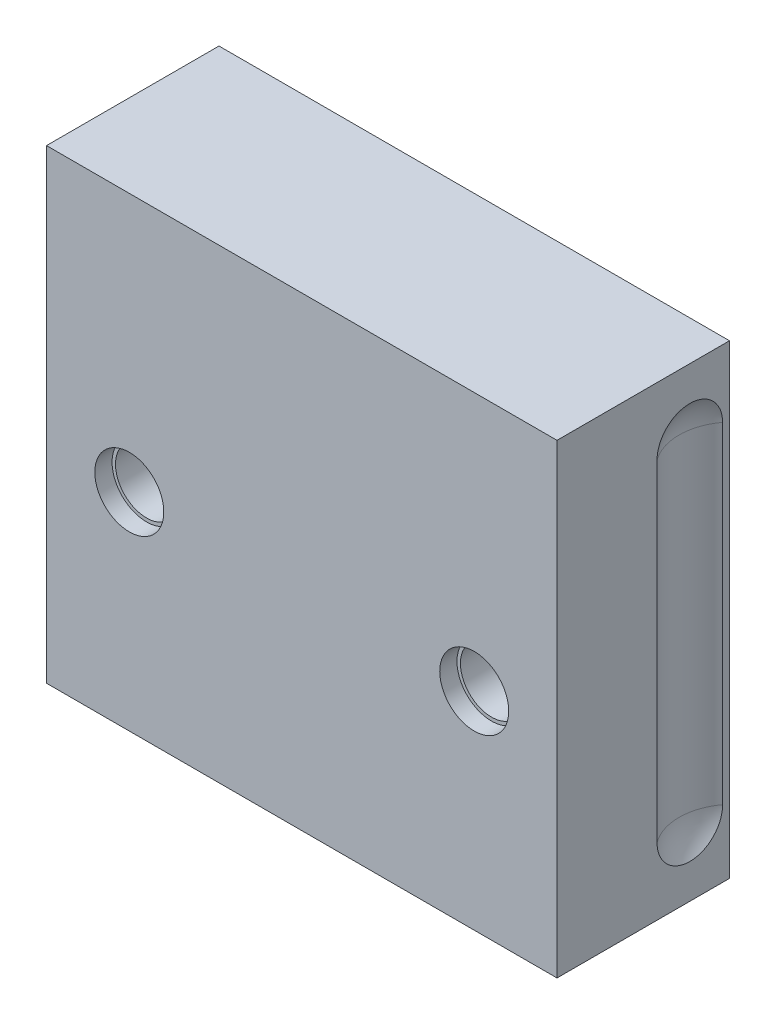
ISO-10303-21;
HEADER;
FILE_DESCRIPTION(('STEP AP214'),'2;1');
FILE_NAME('part.step','',(''),(''),'','','');
FILE_SCHEMA(('AUTOMOTIVE_DESIGN { 1 0 10303 214 1 1 1 1 }'));
ENDSEC;
DATA;
#1=APPLICATION_CONTEXT('core data for automotive mechanical design processes');
#2=APPLICATION_PROTOCOL_DEFINITION('international standard','automotive_design',2000,#1);
#3=PRODUCT_CONTEXT('',#1,'mechanical');
#4=PRODUCT('Part','Part','',(#3));
#5=PRODUCT_RELATED_PRODUCT_CATEGORY('part','',(#4));
#6=PRODUCT_DEFINITION_FORMATION('','',#4);
#7=PRODUCT_DEFINITION_CONTEXT('part definition',#1,'design');
#8=PRODUCT_DEFINITION('design','',#6,#7);
#9=PRODUCT_DEFINITION_SHAPE('','',#8);
#10=(LENGTH_UNIT() NAMED_UNIT(*) SI_UNIT(.MILLI.,.METRE.));
#11=(NAMED_UNIT(*) PLANE_ANGLE_UNIT() SI_UNIT($,.RADIAN.));
#12=(NAMED_UNIT(*) SI_UNIT($,.STERADIAN.) SOLID_ANGLE_UNIT());
#13=UNCERTAINTY_MEASURE_WITH_UNIT(LENGTH_MEASURE(1.E-05),#10,'distance_accuracy_value','');
#14=(GEOMETRIC_REPRESENTATION_CONTEXT(3) GLOBAL_UNCERTAINTY_ASSIGNED_CONTEXT((#13)) GLOBAL_UNIT_ASSIGNED_CONTEXT((#10,
#11,#12)) REPRESENTATION_CONTEXT('',''));
#15=CARTESIAN_POINT('',(0.,0.,0.));
#16=DIRECTION('',(0.,0.,1.));
#17=DIRECTION('',(1.,0.,0.));
#18=AXIS2_PLACEMENT_3D('',#15,#16,#17);
#19=CARTESIAN_POINT('',(-74.5004119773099,100.799588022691,94.5));
#20=DIRECTION('',(0.,0.,-1.));
#21=DIRECTION('',(-1.,0.,0.));
#22=AXIS2_PLACEMENT_3D('',#19,#20,#21);
#23=CYLINDRICAL_SURFACE('',#22,5.);
#24=CARTESIAN_POINT('',(-74.5004119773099,100.799588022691,62.5));
#25=DIRECTION('',(0.,0.,-1.));
#26=DIRECTION('',(-1.,0.,0.));
#27=AXIS2_PLACEMENT_3D('',#24,#25,#26);
#28=CIRCLE('',#27,5.);
#29=CARTESIAN_POINT('',(-79.5004119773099,100.799588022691,62.5));
#30=VERTEX_POINT('',#29);
#31=EDGE_CURVE('E341',#30,#30,#28,.F.);
#32=ORIENTED_EDGE('',*,*,#31,.F.);
#33=EDGE_LOOP('',(#32));
#34=FACE_BOUND('',#33,.T.);
#35=CARTESIAN_POINT('',(-74.5004119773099,100.799588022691,84.5));
#36=DIRECTION('',(0.,0.,-1.));
#37=DIRECTION('',(-1.,0.,0.));
#38=AXIS2_PLACEMENT_3D('',#35,#36,#37);
#39=CIRCLE('',#38,5.);
#40=CARTESIAN_POINT('',(-79.5004119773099,100.799588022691,84.5));
#41=VERTEX_POINT('',#40);
#42=EDGE_CURVE('E18',#41,#41,#39,.F.);
#43=ORIENTED_EDGE('',*,*,#42,.T.);
#44=EDGE_LOOP('',(#43));
#45=FACE_BOUND('',#44,.T.);
#46=ADVANCED_FACE('F14',(#34,#45),#23,.F.);
#47=CARTESIAN_POINT('',(-174.50041197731,100.799588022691,94.5));
#48=DIRECTION('',(0.,0.,-1.));
#49=DIRECTION('',(-1.,0.,0.));
#50=AXIS2_PLACEMENT_3D('',#47,#48,#49);
#51=CYLINDRICAL_SURFACE('',#50,5.);
#52=CARTESIAN_POINT('',(-174.50041197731,100.799588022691,62.5));
#53=DIRECTION('',(0.,0.,-1.));
#54=DIRECTION('',(-1.,0.,0.));
#55=AXIS2_PLACEMENT_3D('',#52,#53,#54);
#56=CIRCLE('',#55,5.);
#57=CARTESIAN_POINT('',(-179.50041197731,100.799588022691,62.5));
#58=VERTEX_POINT('',#57);
#59=EDGE_CURVE('E335',#58,#58,#56,.F.);
#60=ORIENTED_EDGE('',*,*,#59,.F.);
#61=EDGE_LOOP('',(#60));
#62=FACE_BOUND('',#61,.T.);
#63=CARTESIAN_POINT('',(-174.50041197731,100.799588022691,84.5));
#64=DIRECTION('',(0.,0.,-1.));
#65=DIRECTION('',(-1.,0.,0.));
#66=AXIS2_PLACEMENT_3D('',#63,#64,#65);
#67=CIRCLE('',#66,5.);
#68=CARTESIAN_POINT('',(-179.50041197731,100.799588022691,84.5));
#69=VERTEX_POINT('',#68);
#70=EDGE_CURVE('E343',#69,#69,#67,.F.);
#71=ORIENTED_EDGE('',*,*,#70,.T.);
#72=EDGE_LOOP('',(#71));
#73=FACE_BOUND('',#72,.T.);
#74=ADVANCED_FACE('F355',(#62,#73),#51,.F.);
#75=CARTESIAN_POINT('',(-74.5004119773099,100.799588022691,84.5));
#76=DIRECTION('',(0.,0.,-1.));
#77=DIRECTION('',(-1.,0.,0.));
#78=AXIS2_PLACEMENT_3D('',#75,#76,#77);
#79=PLANE('',#78);
#80=ORIENTED_EDGE('',*,*,#42,.F.);
#81=EDGE_LOOP('',(#80));
#82=FACE_BOUND('',#81,.T.);
#83=CARTESIAN_POINT('',(-74.5004119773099,100.799588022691,84.5));
#84=DIRECTION('',(0.,0.,-1.));
#85=DIRECTION('',(-1.,0.,0.));
#86=AXIS2_PLACEMENT_3D('',#83,#84,#85);
#87=CIRCLE('',#86,9.);
#88=CARTESIAN_POINT('',(-83.5004119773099,100.799588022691,84.5));
#89=VERTEX_POINT('',#88);
#90=EDGE_CURVE('E329',#89,#89,#87,.F.);
#91=ORIENTED_EDGE('',*,*,#90,.T.);
#92=EDGE_LOOP('',(#91));
#93=FACE_BOUND('',#92,.T.);
#94=ADVANCED_FACE('F351',(#82,#93),#79,.F.);
#95=CARTESIAN_POINT('',(-174.50041197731,100.799588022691,84.5));
#96=DIRECTION('',(0.,0.,-1.));
#97=DIRECTION('',(-1.,0.,0.));
#98=AXIS2_PLACEMENT_3D('',#95,#96,#97);
#99=PLANE('',#98);
#100=ORIENTED_EDGE('',*,*,#70,.F.);
#101=EDGE_LOOP('',(#100));
#102=FACE_BOUND('',#101,.T.);
#103=CARTESIAN_POINT('',(-174.50041197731,100.799588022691,84.5));
#104=DIRECTION('',(0.,0.,-1.));
#105=DIRECTION('',(-1.,0.,0.));
#106=AXIS2_PLACEMENT_3D('',#103,#104,#105);
#107=CIRCLE('',#106,9.);
#108=CARTESIAN_POINT('',(-183.50041197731,100.799588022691,84.5));
#109=VERTEX_POINT('',#108);
#110=EDGE_CURVE('E326',#109,#109,#107,.F.);
#111=ORIENTED_EDGE('',*,*,#110,.T.);
#112=EDGE_LOOP('',(#111));
#113=FACE_BOUND('',#112,.T.);
#114=ADVANCED_FACE('F354',(#102,#113),#99,.F.);
#115=CARTESIAN_POINT('',(-74.5004119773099,100.799588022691,62.5));
#116=DIRECTION('',(0.,0.,-1.));
#117=DIRECTION('',(-1.,0.,0.));
#118=AXIS2_PLACEMENT_3D('',#115,#116,#117);
#119=PLANE('',#118);
#120=CARTESIAN_POINT('',(-74.5004119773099,100.799588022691,62.5));
#121=DIRECTION('',(0.,0.,-1.));
#122=DIRECTION('',(-1.,0.,0.));
#123=AXIS2_PLACEMENT_3D('',#120,#121,#122);
#124=CIRCLE('',#123,9.);
#125=CARTESIAN_POINT('',(-83.5004119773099,100.799588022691,62.5));
#126=VERTEX_POINT('',#125);
#127=EDGE_CURVE('E328',#126,#126,#124,.F.);
#128=ORIENTED_EDGE('',*,*,#127,.F.);
#129=EDGE_LOOP('',(#128));
#130=FACE_BOUND('',#129,.T.);
#131=ORIENTED_EDGE('',*,*,#31,.T.);
#132=EDGE_LOOP('',(#131));
#133=FACE_BOUND('',#132,.T.);
#134=ADVANCED_FACE('F628',(#130,#133),#119,.T.);
#135=CARTESIAN_POINT('',(-174.50041197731,100.799588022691,62.5));
#136=DIRECTION('',(0.,0.,-1.));
#137=DIRECTION('',(-1.,0.,0.));
#138=AXIS2_PLACEMENT_3D('',#135,#136,#137);
#139=PLANE('',#138);
#140=CARTESIAN_POINT('',(-174.50041197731,100.799588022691,62.5));
#141=DIRECTION('',(0.,0.,-1.));
#142=DIRECTION('',(-1.,0.,0.));
#143=AXIS2_PLACEMENT_3D('',#140,#141,#142);
#144=CIRCLE('',#143,9.);
#145=CARTESIAN_POINT('',(-183.50041197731,100.799588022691,62.5));
#146=VERTEX_POINT('',#145);
#147=EDGE_CURVE('E332',#146,#146,#144,.F.);
#148=ORIENTED_EDGE('',*,*,#147,.F.);
#149=EDGE_LOOP('',(#148));
#150=FACE_BOUND('',#149,.T.);
#151=ORIENTED_EDGE('',*,*,#59,.T.);
#152=EDGE_LOOP('',(#151));
#153=FACE_BOUND('',#152,.T.);
#154=ADVANCED_FACE('F398',(#150,#153),#139,.T.);
#155=CARTESIAN_POINT('',(-136.01541197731,78.7995880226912,83.));
#156=DIRECTION('',(0.,0.,-1.));
#157=DIRECTION('',(-1.,0.,0.));
#158=AXIS2_PLACEMENT_3D('',#155,#156,#157);
#159=TOROIDAL_SURFACE('',#158,9.00000000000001,2.5);
#160=CARTESIAN_POINT('',(-147.50041197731,78.7995880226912,83.2734501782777));
#161=CARTESIAN_POINT('',(-147.50041197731,78.8523853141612,83.2734552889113));
#162=CARTESIAN_POINT('',(-147.50041197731,78.90520941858,83.2701925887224));
#163=CARTESIAN_POINT('',(-147.50041197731,78.9836502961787,83.2600004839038));
#164=CARTESIAN_POINT('',(-147.50041197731,79.0096313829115,83.2557291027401));
#165=CARTESIAN_POINT('',(-147.50041197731,79.0612155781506,83.2452152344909));
#166=CARTESIAN_POINT('',(-147.50041197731,79.086818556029,83.2389720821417));
#167=CARTESIAN_POINT('',(-147.50041197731,79.1319268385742,83.2257832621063));
#168=CARTESIAN_POINT('',(-147.50041197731,79.1515600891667,83.2192769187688));
#169=CARTESIAN_POINT('',(-147.50041197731,79.1901876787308,83.204608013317));
#170=CARTESIAN_POINT('',(-147.50041197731,79.2091827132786,83.1964473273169));
#171=CARTESIAN_POINT('',(-147.50041197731,79.2463977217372,83.1779977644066));
#172=CARTESIAN_POINT('',(-147.50041197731,79.264606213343,83.1676854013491));
#173=CARTESIAN_POINT('',(-147.50041197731,79.2992587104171,83.1444367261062));
#174=CARTESIAN_POINT('',(-147.500411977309,79.3157105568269,83.1315128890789));
#175=CARTESIAN_POINT('',(-147.50041197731,79.3371665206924,83.1103383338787));
#176=CARTESIAN_POINT('',(-147.50041197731,79.3434882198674,83.1034297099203));
#177=CARTESIAN_POINT('',(-147.50041197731,79.3552200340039,83.0888561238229));
#178=CARTESIAN_POINT('',(-147.50041197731,79.3606295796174,83.0811906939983));
#179=CARTESIAN_POINT('',(-147.50041197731,79.3702638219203,83.0649921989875));
#180=CARTESIAN_POINT('',(-147.50041197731,79.3744718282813,83.056448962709));
#181=CARTESIAN_POINT('',(-147.50041197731,79.3811753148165,83.0387301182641));
#182=CARTESIAN_POINT('',(-147.50041197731,79.3836772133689,83.0295570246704));
#183=CARTESIAN_POINT('',(-147.50041197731,79.3864936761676,83.0118191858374));
#184=CARTESIAN_POINT('',(-147.50041197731,79.3870027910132,83.0032859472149));
#185=CARTESIAN_POINT('',(-147.50041197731,79.386311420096,82.9862928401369));
#186=CARTESIAN_POINT('',(-147.50041197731,79.3851107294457,82.9778329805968));
#187=CARTESIAN_POINT('',(-147.50041197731,79.379732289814,82.9554528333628));
#188=CARTESIAN_POINT('',(-147.50041197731,79.37405212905,82.9418895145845));
#189=CARTESIAN_POINT('',(-147.50041197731,79.3609320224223,82.9189771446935));
#190=CARTESIAN_POINT('',(-147.50041197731,79.354001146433,82.909310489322));
#191=CARTESIAN_POINT('',(-147.50041197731,79.338733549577,82.8911398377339));
#192=CARTESIAN_POINT('',(-147.50041197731,79.3303933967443,82.8826387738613));
#193=CARTESIAN_POINT('',(-147.50041197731,79.3060854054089,82.8606392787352));
#194=CARTESIAN_POINT('',(-147.50041197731,79.2891329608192,82.8482454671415));
#195=CARTESIAN_POINT('',(-147.50041197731,79.2536796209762,82.8259633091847));
#196=CARTESIAN_POINT('',(-147.50041197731,79.2351750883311,82.8160810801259));
#197=CARTESIAN_POINT('',(-147.50041197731,79.1971116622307,82.7982439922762));
#198=CARTESIAN_POINT('',(-147.50041197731,79.1775462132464,82.7903033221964));
#199=CARTESIAN_POINT('',(-147.50041197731,79.1378189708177,82.7760830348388));
#200=CARTESIAN_POINT('',(-147.50041197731,79.117656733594,82.7698046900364));
#201=CARTESIAN_POINT('',(-147.50041197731,79.0564970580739,82.753065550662));
#202=CARTESIAN_POINT('',(-147.50041197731,79.0149100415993,82.7447364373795));
#203=CARTESIAN_POINT('',(-147.50041197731,78.9387826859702,82.7338085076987));
#204=CARTESIAN_POINT('',(-147.50041197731,78.9043416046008,82.7304412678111));
#205=CARTESIAN_POINT('',(-147.50041197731,78.8352661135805,82.7265736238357));
#206=CARTESIAN_POINT('',(-147.50041197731,78.8006315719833,82.7260755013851));
#207=CARTESIAN_POINT('',(-147.50041197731,78.7314761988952,82.7279146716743));
#208=CARTESIAN_POINT('',(-147.50041197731,78.6969552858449,82.7302489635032));
#209=CARTESIAN_POINT('',(-147.50041197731,78.6282642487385,82.7379061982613));
#210=CARTESIAN_POINT('',(-147.50041197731,78.5940938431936,82.7432265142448));
#211=CARTESIAN_POINT('',(-147.50041197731,78.5276303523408,82.7570160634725));
#212=CARTESIAN_POINT('',(-147.500411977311,78.4953133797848,82.7653688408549));
#213=CARTESIAN_POINT('',(-147.500411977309,78.4319654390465,82.7859159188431));
#214=CARTESIAN_POINT('',(-147.500411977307,78.4009302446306,82.798096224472));
#215=CARTESIAN_POINT('',(-147.500411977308,78.3569240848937,82.8199636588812));
#216=CARTESIAN_POINT('',(-147.50041197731,78.3429612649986,82.8276467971));
#217=CARTESIAN_POINT('',(-147.50041197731,78.3159452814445,82.8444560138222));
#218=CARTESIAN_POINT('',(-147.50041197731,78.3028904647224,82.853579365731));
#219=CARTESIAN_POINT('',(-147.50041197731,78.2804496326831,82.871768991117));
#220=CARTESIAN_POINT('',(-147.50041197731,78.2708294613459,82.8805400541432));
#221=CARTESIAN_POINT('',(-147.50041197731,78.2530400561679,82.8994148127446));
#222=CARTESIAN_POINT('',(-147.50041197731,78.244866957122,82.9095148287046));
#223=CARTESIAN_POINT('',(-147.50041197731,78.228710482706,82.9343470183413));
#224=CARTESIAN_POINT('',(-147.50041197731,78.2214240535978,82.9495836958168));
#225=CARTESIAN_POINT('',(-147.50041197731,78.2148574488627,82.9737193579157));
#226=CARTESIAN_POINT('',(-147.50041197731,78.213400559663,82.9820332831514));
#227=CARTESIAN_POINT('',(-147.50041197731,78.21214518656,82.9987883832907));
#228=CARTESIAN_POINT('',(-147.50041197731,78.2123456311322,83.0072294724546));
#229=CARTESIAN_POINT('',(-147.50041197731,78.2142477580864,83.0228241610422));
#230=CARTESIAN_POINT('',(-147.50041197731,78.2157521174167,83.0300031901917));
#231=CARTESIAN_POINT('',(-147.50041197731,78.2198622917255,83.0440462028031));
#232=CARTESIAN_POINT('',(-147.50041197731,78.2224701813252,83.0509095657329));
#233=CARTESIAN_POINT('',(-147.50041197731,78.23432121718,83.0765965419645));
#234=CARTESIAN_POINT('',(-147.50041197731,78.2468761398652,83.0938883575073));
#235=CARTESIAN_POINT('',(-147.50041197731,78.2732469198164,83.1221499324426));
#236=CARTESIAN_POINT('',(-147.50041197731,78.2865264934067,83.1336903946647));
#237=CARTESIAN_POINT('',(-147.50041197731,78.3146322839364,83.1547882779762));
#238=CARTESIAN_POINT('',(-147.50041197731,78.3294627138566,83.1643400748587));
#239=CARTESIAN_POINT('',(-147.50041197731,78.3598439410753,83.1816683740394));
#240=CARTESIAN_POINT('',(-147.50041197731,78.3753829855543,83.1894661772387));
#241=CARTESIAN_POINT('',(-147.50041197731,78.4070643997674,83.2037344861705));
#242=CARTESIAN_POINT('',(-147.50041197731,78.423207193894,83.2102040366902));
#243=CARTESIAN_POINT('',(-147.50041197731,78.4722697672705,83.2279283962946));
#244=CARTESIAN_POINT('',(-147.50041197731,78.5058007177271,83.2374868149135));
#245=CARTESIAN_POINT('',(-147.50041197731,78.582260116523,83.2550274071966));
#246=CARTESIAN_POINT('',(-147.50041197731,78.6254122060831,83.2619925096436));
#247=CARTESIAN_POINT('',(-147.50041197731,78.7122324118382,83.271204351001));
#248=CARTESIAN_POINT('',(-147.50041197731,78.7559010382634,83.273445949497));
#249=CARTESIAN_POINT('',(-147.50041197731,78.7995880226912,83.2734501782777));
#250=B_SPLINE_CURVE_WITH_KNOTS('',3,(#160,#161,#162,#163,#164,#165,#166,#167,#168,#169,#170,
#171,#172,#173,#174,#175,#176,#177,#178,#179,#180,#181,#182,#183,#184,#185,#186,#187,#188,#189,
#190,#191,#192,#193,#194,#195,#196,#197,#198,#199,#200,#201,#202,#203,#204,#205,#206,#207,#208,
#209,#210,#211,#212,#213,#214,#215,#216,#217,#218,#219,#220,#221,#222,#223,#224,#225,#226,#227,
#228,#229,#230,#231,#232,#233,#234,#235,#236,#237,#238,#239,#240,#241,#242,#243,#244,#245,#246,
#247,#248,#249),.UNSPECIFIED.,.T.,.F.,(4,2,2,2,2,2,2,2,2,2,2,2,2,2,2,2,2,2,2,2,2,2,2,2,2,2,2,2,
2,2,2,2,2,2,2,2,2,2,2,2,2,2,2,2,4),(0.,0.158280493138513,0.237215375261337,0.31617691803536,
0.378168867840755,0.440090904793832,0.502727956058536,0.56507257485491,0.593109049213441,
0.621162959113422,0.649589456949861,0.67790841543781,0.703381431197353,0.72885749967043,
0.772301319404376,0.80783110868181,0.84344870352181,0.906101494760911,0.968905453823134,
1.03215550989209,1.09545384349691,1.22232014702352,1.326030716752,1.42982374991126,
1.53350691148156,1.6370990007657,1.73707341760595,1.83668645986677,1.88443333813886,
1.93209088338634,1.97102529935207,2.00985409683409,2.05957979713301,2.08475480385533,
2.10991353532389,2.13182148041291,2.15377079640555,2.2165997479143,2.269220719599,
2.32198854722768,2.3740760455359,2.426200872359,2.5305277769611,2.66135426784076,
2.79232305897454),.UNSPECIFIED.);
#251=CARTESIAN_POINT('',(-147.50041197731,78.7995880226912,83.2734501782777));
#252=VERTEX_POINT('',#251);
#253=EDGE_CURVE('E386',#252,#252,#250,.T.);
#254=ORIENTED_EDGE('',*,*,#253,.F.);
#255=EDGE_LOOP('',(#254));
#256=FACE_BOUND('',#255,.T.);
#257=ADVANCED_FACE('F392',(#256),#159,.F.);
#258=CARTESIAN_POINT('',(-136.01541197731,137.799588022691,83.));
#259=DIRECTION('',(0.,0.,-1.));
#260=DIRECTION('',(-1.,0.,0.));
#261=AXIS2_PLACEMENT_3D('',#258,#259,#260);
#262=TOROIDAL_SURFACE('',#261,9.00000000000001,2.5);
#263=CARTESIAN_POINT('',(-147.50041197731,137.799588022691,83.2734501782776));
#264=CARTESIAN_POINT('',(-147.50041197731,137.852385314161,83.2734552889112));
#265=CARTESIAN_POINT('',(-147.50041197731,137.90520941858,83.2701925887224));
#266=CARTESIAN_POINT('',(-147.50041197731,137.983650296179,83.260000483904));
#267=CARTESIAN_POINT('',(-147.50041197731,138.009631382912,83.2557291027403));
#268=CARTESIAN_POINT('',(-147.50041197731,138.061215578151,83.2452152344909));
#269=CARTESIAN_POINT('',(-147.50041197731,138.086818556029,83.2389720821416));
#270=CARTESIAN_POINT('',(-147.50041197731,138.131926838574,83.2257832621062));
#271=CARTESIAN_POINT('',(-147.50041197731,138.151560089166,83.2192769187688));
#272=CARTESIAN_POINT('',(-147.50041197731,138.19018767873,83.2046080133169));
#273=CARTESIAN_POINT('',(-147.50041197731,138.209182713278,83.1964473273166));
#274=CARTESIAN_POINT('',(-147.50041197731,138.246397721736,83.1779977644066));
#275=CARTESIAN_POINT('',(-147.50041197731,138.264606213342,83.1676854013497));
#276=CARTESIAN_POINT('',(-147.50041197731,138.299258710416,83.1444367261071));
#277=CARTESIAN_POINT('',(-147.500411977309,138.315710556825,83.1315128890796));
#278=CARTESIAN_POINT('',(-147.50041197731,138.337166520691,83.1103383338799));
#279=CARTESIAN_POINT('',(-147.50041197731,138.343488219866,83.1034297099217));
#280=CARTESIAN_POINT('',(-147.50041197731,138.355220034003,83.0888561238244));
#281=CARTESIAN_POINT('',(-147.50041197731,138.360629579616,83.0811906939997));
#282=CARTESIAN_POINT('',(-147.50041197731,138.370263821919,83.0649921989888));
#283=CARTESIAN_POINT('',(-147.50041197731,138.37447182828,83.0564489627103));
#284=CARTESIAN_POINT('',(-147.50041197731,138.381175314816,83.0387301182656));
#285=CARTESIAN_POINT('',(-147.50041197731,138.383677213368,83.029557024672));
#286=CARTESIAN_POINT('',(-147.50041197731,138.386493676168,83.011819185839));
#287=CARTESIAN_POINT('',(-147.50041197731,138.387002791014,83.0032859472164));
#288=CARTESIAN_POINT('',(-147.50041197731,138.386311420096,82.9862928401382));
#289=CARTESIAN_POINT('',(-147.50041197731,138.385110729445,82.977832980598));
#290=CARTESIAN_POINT('',(-147.50041197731,138.379732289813,82.9554528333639));
#291=CARTESIAN_POINT('',(-147.50041197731,138.37405212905,82.9418895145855));
#292=CARTESIAN_POINT('',(-147.50041197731,138.360932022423,82.9189771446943));
#293=CARTESIAN_POINT('',(-147.50041197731,138.354001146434,82.9093104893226));
#294=CARTESIAN_POINT('',(-147.50041197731,138.338733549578,82.8911398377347));
#295=CARTESIAN_POINT('',(-147.50041197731,138.330393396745,82.8826387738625));
#296=CARTESIAN_POINT('',(-147.50041197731,138.306085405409,82.8606392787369));
#297=CARTESIAN_POINT('',(-147.50041197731,138.28913296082,82.8482454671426));
#298=CARTESIAN_POINT('',(-147.50041197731,138.253679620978,82.8259633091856));
#299=CARTESIAN_POINT('',(-147.50041197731,138.235175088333,82.8160810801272));
#300=CARTESIAN_POINT('',(-147.50041197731,138.197111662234,82.7982439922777));
#301=CARTESIAN_POINT('',(-147.50041197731,138.17754621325,82.7903033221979));
#302=CARTESIAN_POINT('',(-147.50041197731,138.137818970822,82.7760830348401));
#303=CARTESIAN_POINT('',(-147.50041197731,138.117656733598,82.7698046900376));
#304=CARTESIAN_POINT('',(-147.50041197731,138.056497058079,82.753065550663));
#305=CARTESIAN_POINT('',(-147.50041197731,138.014910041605,82.7447364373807));
#306=CARTESIAN_POINT('',(-147.50041197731,137.938782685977,82.7338085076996));
#307=CARTESIAN_POINT('',(-147.50041197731,137.904341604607,82.7304412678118));
#308=CARTESIAN_POINT('',(-147.50041197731,137.835266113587,82.7265736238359));
#309=CARTESIAN_POINT('',(-147.50041197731,137.80063157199,82.726075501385));
#310=CARTESIAN_POINT('',(-147.50041197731,137.731476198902,82.7279146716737));
#311=CARTESIAN_POINT('',(-147.50041197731,137.696955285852,82.7302489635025));
#312=CARTESIAN_POINT('',(-147.50041197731,137.628264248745,82.7379061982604));
#313=CARTESIAN_POINT('',(-147.50041197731,137.594093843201,82.743226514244));
#314=CARTESIAN_POINT('',(-147.50041197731,137.527630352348,82.7570160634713));
#315=CARTESIAN_POINT('',(-147.500411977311,137.495313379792,82.7653688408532));
#316=CARTESIAN_POINT('',(-147.500411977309,137.431965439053,82.7859159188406));
#317=CARTESIAN_POINT('',(-147.500411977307,137.400930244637,82.7980962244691));
#318=CARTESIAN_POINT('',(-147.500411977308,137.356924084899,82.8199636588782));
#319=CARTESIAN_POINT('',(-147.50041197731,137.342961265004,82.8276467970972));
#320=CARTESIAN_POINT('',(-147.50041197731,137.315945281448,82.8444560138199));
#321=CARTESIAN_POINT('',(-147.50041197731,137.302890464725,82.853579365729));
#322=CARTESIAN_POINT('',(-147.50041197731,137.280449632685,82.8717689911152));
#323=CARTESIAN_POINT('',(-147.50041197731,137.270829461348,82.8805400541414));
#324=CARTESIAN_POINT('',(-147.50041197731,137.25304005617,82.8994148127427));
#325=CARTESIAN_POINT('',(-147.50041197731,137.244866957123,82.9095148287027));
#326=CARTESIAN_POINT('',(-147.50041197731,137.228710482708,82.9343470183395));
#327=CARTESIAN_POINT('',(-147.50041197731,137.2214240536,82.9495836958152));
#328=CARTESIAN_POINT('',(-147.50041197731,137.214857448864,82.9737193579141));
#329=CARTESIAN_POINT('',(-147.50041197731,137.213400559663,82.9820332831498));
#330=CARTESIAN_POINT('',(-147.50041197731,137.21214518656,82.9987883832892));
#331=CARTESIAN_POINT('',(-147.50041197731,137.212345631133,83.0072294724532));
#332=CARTESIAN_POINT('',(-147.50041197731,137.214247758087,83.022824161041));
#333=CARTESIAN_POINT('',(-147.50041197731,137.215752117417,83.0300031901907));
#334=CARTESIAN_POINT('',(-147.50041197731,137.219862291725,83.0440462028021));
#335=CARTESIAN_POINT('',(-147.50041197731,137.222470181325,83.0509095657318));
#336=CARTESIAN_POINT('',(-147.50041197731,137.23432121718,83.0765965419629));
#337=CARTESIAN_POINT('',(-147.50041197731,137.246876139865,83.0938883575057));
#338=CARTESIAN_POINT('',(-147.50041197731,137.273246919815,83.1221499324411));
#339=CARTESIAN_POINT('',(-147.50041197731,137.286526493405,83.1336903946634));
#340=CARTESIAN_POINT('',(-147.50041197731,137.314632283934,83.1547882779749));
#341=CARTESIAN_POINT('',(-147.50041197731,137.329462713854,83.1643400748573));
#342=CARTESIAN_POINT('',(-147.50041197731,137.359843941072,83.1816683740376));
#343=CARTESIAN_POINT('',(-147.50041197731,137.375382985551,83.1894661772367));
#344=CARTESIAN_POINT('',(-147.50041197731,137.407064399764,83.2037344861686));
#345=CARTESIAN_POINT('',(-147.50041197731,137.42320719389,83.2102040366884));
#346=CARTESIAN_POINT('',(-147.50041197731,137.472269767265,83.2279283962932));
#347=CARTESIAN_POINT('',(-147.50041197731,137.505800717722,83.2374868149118));
#348=CARTESIAN_POINT('',(-147.50041197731,137.582260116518,83.2550274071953));
#349=CARTESIAN_POINT('',(-147.50041197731,137.625412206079,83.2619925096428));
#350=CARTESIAN_POINT('',(-147.50041197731,137.712232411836,83.2712043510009));
#351=CARTESIAN_POINT('',(-147.50041197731,137.755901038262,83.2734459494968));
#352=CARTESIAN_POINT('',(-147.50041197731,137.799588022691,83.2734501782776));
#353=B_SPLINE_CURVE_WITH_KNOTS('',3,(#263,#264,#265,#266,#267,#268,#269,#270,#271,#272,#273,
#274,#275,#276,#277,#278,#279,#280,#281,#282,#283,#284,#285,#286,#287,#288,#289,#290,#291,#292,
#293,#294,#295,#296,#297,#298,#299,#300,#301,#302,#303,#304,#305,#306,#307,#308,#309,#310,#311,
#312,#313,#314,#315,#316,#317,#318,#319,#320,#321,#322,#323,#324,#325,#326,#327,#328,#329,#330,
#331,#332,#333,#334,#335,#336,#337,#338,#339,#340,#341,#342,#343,#344,#345,#346,#347,#348,#349,
#350,#351,#352),.UNSPECIFIED.,.T.,.F.,(4,2,2,2,2,2,2,2,2,2,2,2,2,2,2,2,2,2,2,2,2,2,2,2,2,2,2,2,
2,2,2,2,2,2,2,2,2,2,2,2,2,2,2,2,4),(0.,0.15828049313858,0.237215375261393,0.316176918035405,
0.378168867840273,0.440090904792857,0.502727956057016,0.565072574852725,0.593109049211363,
0.621162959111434,0.649589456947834,0.677908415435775,0.703381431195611,0.728857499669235,
0.772301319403,0.807831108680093,0.843448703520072,0.906101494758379,0.968905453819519,
1.03215550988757,1.09545384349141,1.22232014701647,1.32603071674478,1.42982374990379,
1.53350691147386,1.63709900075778,1.73707341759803,1.83668645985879,1.884433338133,
1.93209088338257,1.97102529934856,2.00985409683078,2.05957979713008,2.08475480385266,
2.10991353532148,2.13182148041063,2.15377079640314,2.21659974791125,2.26922071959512,
2.32198854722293,2.37407604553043,2.42620087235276,2.53052777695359,2.66135426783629,
2.79232305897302),.UNSPECIFIED.);
#354=CARTESIAN_POINT('',(-147.50041197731,137.799588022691,83.2734501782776));
#355=VERTEX_POINT('',#354);
#356=EDGE_CURVE('E380',#355,#355,#353,.T.);
#357=ORIENTED_EDGE('',*,*,#356,.F.);
#358=EDGE_LOOP('',(#357));
#359=FACE_BOUND('',#358,.T.);
#360=ADVANCED_FACE('F397',(#359),#262,.F.);
#361=CARTESIAN_POINT('',(-112.98541197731,78.7995880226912,83.));
#362=DIRECTION('',(0.,0.,-1.));
#363=DIRECTION('',(-1.,0.,0.));
#364=AXIS2_PLACEMENT_3D('',#361,#362,#363);
#365=TOROIDAL_SURFACE('',#364,8.99999999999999,2.5);
#366=CARTESIAN_POINT('',(-101.50041197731,78.7995880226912,83.2734501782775));
#367=CARTESIAN_POINT('',(-101.50041197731,78.7467907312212,83.2734552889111));
#368=CARTESIAN_POINT('',(-101.50041197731,78.6939666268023,83.2701925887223));
#369=CARTESIAN_POINT('',(-101.50041197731,78.6155257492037,83.2600004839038));
#370=CARTESIAN_POINT('',(-101.50041197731,78.5895446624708,83.2557291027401));
#371=CARTESIAN_POINT('',(-101.50041197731,78.5379604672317,83.2452152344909));
#372=CARTESIAN_POINT('',(-101.50041197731,78.5123574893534,83.2389720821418));
#373=CARTESIAN_POINT('',(-101.50041197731,78.4672492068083,83.2257832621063));
#374=CARTESIAN_POINT('',(-101.50041197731,78.447615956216,83.2192769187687));
#375=CARTESIAN_POINT('',(-101.50041197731,78.4089883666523,83.2046080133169));
#376=CARTESIAN_POINT('',(-101.50041197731,78.3899933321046,83.1964473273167));
#377=CARTESIAN_POINT('',(-101.50041197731,78.3527783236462,83.1779977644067));
#378=CARTESIAN_POINT('',(-101.50041197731,78.3345698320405,83.1676854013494));
#379=CARTESIAN_POINT('',(-101.50041197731,78.2999173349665,83.1444367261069));
#380=CARTESIAN_POINT('',(-101.50041197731,78.2834654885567,83.1315128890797));
#381=CARTESIAN_POINT('',(-101.50041197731,78.2620095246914,83.1103383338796));
#382=CARTESIAN_POINT('',(-101.50041197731,78.2556878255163,83.1034297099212));
#383=CARTESIAN_POINT('',(-101.50041197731,78.2439560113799,83.0888561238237));
#384=CARTESIAN_POINT('',(-101.50041197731,78.2385464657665,83.081190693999));
#385=CARTESIAN_POINT('',(-101.50041197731,78.2289122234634,83.0649921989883));
#386=CARTESIAN_POINT('',(-101.50041197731,78.2247042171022,83.0564489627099));
#387=CARTESIAN_POINT('',(-101.50041197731,78.2180007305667,83.0387301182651));
#388=CARTESIAN_POINT('',(-101.50041197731,78.2154988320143,83.0295570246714));
#389=CARTESIAN_POINT('',(-101.50041197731,78.2126823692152,83.0118191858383));
#390=CARTESIAN_POINT('',(-101.50041197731,78.2121732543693,83.0032859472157));
#391=CARTESIAN_POINT('',(-101.50041197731,78.2128646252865,82.9862928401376));
#392=CARTESIAN_POINT('',(-101.50041197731,78.2140653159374,82.9778329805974));
#393=CARTESIAN_POINT('',(-101.50041197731,78.2194437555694,82.9554528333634));
#394=CARTESIAN_POINT('',(-101.50041197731,78.2251239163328,82.9418895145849));
#395=CARTESIAN_POINT('',(-101.50041197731,78.23824402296,82.9189771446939));
#396=CARTESIAN_POINT('',(-101.50041197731,78.2451748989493,82.9093104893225));
#397=CARTESIAN_POINT('',(-101.50041197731,78.2604424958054,82.8911398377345));
#398=CARTESIAN_POINT('',(-101.50041197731,78.2687826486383,82.8826387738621));
#399=CARTESIAN_POINT('',(-101.50041197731,78.2930906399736,82.8606392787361));
#400=CARTESIAN_POINT('',(-101.50041197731,78.3100430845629,82.848245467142));
#401=CARTESIAN_POINT('',(-101.50041197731,78.3454964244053,82.825963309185));
#402=CARTESIAN_POINT('',(-101.50041197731,78.3640009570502,82.8160810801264));
#403=CARTESIAN_POINT('',(-101.50041197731,78.4020643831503,82.7982439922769));
#404=CARTESIAN_POINT('',(-101.50041197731,78.4216298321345,82.7903033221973));
#405=CARTESIAN_POINT('',(-101.50041197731,78.4613570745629,82.7760830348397));
#406=CARTESIAN_POINT('',(-101.50041197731,78.4815193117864,82.7698046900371));
#407=CARTESIAN_POINT('',(-101.50041197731,78.542678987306,82.7530655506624));
#408=CARTESIAN_POINT('',(-101.50041197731,78.5842660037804,82.7447364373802));
#409=CARTESIAN_POINT('',(-101.50041197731,78.6603933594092,82.7338085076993));
#410=CARTESIAN_POINT('',(-101.50041197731,78.6948344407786,82.7304412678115));
#411=CARTESIAN_POINT('',(-101.50041197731,78.7639099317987,82.7265736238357));
#412=CARTESIAN_POINT('',(-101.50041197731,78.7985444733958,82.7260755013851));
#413=CARTESIAN_POINT('',(-101.50041197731,78.8676998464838,82.7279146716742));
#414=CARTESIAN_POINT('',(-101.50041197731,78.902220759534,82.7302489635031));
#415=CARTESIAN_POINT('',(-101.50041197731,78.9709117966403,82.7379061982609));
#416=CARTESIAN_POINT('',(-101.50041197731,79.005082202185,82.7432265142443));
#417=CARTESIAN_POINT('',(-101.50041197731,79.0715456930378,82.7570160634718));
#418=CARTESIAN_POINT('',(-101.500411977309,79.1038626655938,82.7653688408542));
#419=CARTESIAN_POINT('',(-101.500411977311,79.1672106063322,82.785915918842));
#420=CARTESIAN_POINT('',(-101.500411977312,79.1982458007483,82.7980962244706));
#421=CARTESIAN_POINT('',(-101.500411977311,79.2422519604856,82.8199636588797));
#422=CARTESIAN_POINT('',(-101.50041197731,79.2562147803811,82.8276467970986));
#423=CARTESIAN_POINT('',(-101.50041197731,79.2832307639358,82.8444560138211));
#424=CARTESIAN_POINT('',(-101.50041197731,79.2962855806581,82.8535793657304));
#425=CARTESIAN_POINT('',(-101.50041197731,79.3187264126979,82.8717689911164));
#426=CARTESIAN_POINT('',(-101.50041197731,79.3283465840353,82.8805400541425));
#427=CARTESIAN_POINT('',(-101.50041197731,79.3461359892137,82.8994148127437));
#428=CARTESIAN_POINT('',(-101.50041197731,79.3543090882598,82.9095148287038));
#429=CARTESIAN_POINT('',(-101.50041197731,79.3704655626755,82.9343470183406));
#430=CARTESIAN_POINT('',(-101.50041197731,79.3777519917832,82.9495836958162));
#431=CARTESIAN_POINT('',(-101.50041197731,79.3843185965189,82.9737193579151));
#432=CARTESIAN_POINT('',(-101.50041197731,79.3857754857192,82.9820332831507));
#433=CARTESIAN_POINT('',(-101.50041197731,79.3870308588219,82.99878838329));
#434=CARTESIAN_POINT('',(-101.50041197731,79.3868304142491,83.007229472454));
#435=CARTESIAN_POINT('',(-101.50041197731,79.384928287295,83.0228241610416));
#436=CARTESIAN_POINT('',(-101.50041197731,79.3834239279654,83.0300031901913));
#437=CARTESIAN_POINT('',(-101.50041197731,79.379313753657,83.0440462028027));
#438=CARTESIAN_POINT('',(-101.50041197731,79.3767058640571,83.0509095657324));
#439=CARTESIAN_POINT('',(-101.50041197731,79.364854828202,83.0765965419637));
#440=CARTESIAN_POINT('',(-101.50041197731,79.3522999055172,83.0938883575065));
#441=CARTESIAN_POINT('',(-101.50041197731,79.3259291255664,83.1221499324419));
#442=CARTESIAN_POINT('',(-101.50041197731,79.3126495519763,83.1336903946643));
#443=CARTESIAN_POINT('',(-101.50041197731,79.2845437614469,83.1547882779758));
#444=CARTESIAN_POINT('',(-101.50041197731,79.2697133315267,83.1643400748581));
#445=CARTESIAN_POINT('',(-101.50041197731,79.2393321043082,83.1816683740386));
#446=CARTESIAN_POINT('',(-101.50041197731,79.2237930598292,83.1894661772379));
#447=CARTESIAN_POINT('',(-101.50041197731,79.1921116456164,83.2037344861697));
#448=CARTESIAN_POINT('',(-101.50041197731,79.17596885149,83.2102040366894));
#449=CARTESIAN_POINT('',(-101.50041197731,79.1269062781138,83.2279283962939));
#450=CARTESIAN_POINT('',(-101.50041197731,79.0933753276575,83.2374868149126));
#451=CARTESIAN_POINT('',(-101.50041197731,79.0169159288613,83.2550274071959));
#452=CARTESIAN_POINT('',(-101.50041197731,78.9737638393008,83.2619925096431));
#453=CARTESIAN_POINT('',(-101.50041197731,78.886943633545,83.2712043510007));
#454=CARTESIAN_POINT('',(-101.50041197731,78.8432750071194,83.2734459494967));
#455=CARTESIAN_POINT('',(-101.50041197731,78.7995880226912,83.2734501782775));
#456=B_SPLINE_CURVE_WITH_KNOTS('',3,(#366,#367,#368,#369,#370,#371,#372,#373,#374,#375,#376,
#377,#378,#379,#380,#381,#382,#383,#384,#385,#386,#387,#388,#389,#390,#391,#392,#393,#394,#395,
#396,#397,#398,#399,#400,#401,#402,#403,#404,#405,#406,#407,#408,#409,#410,#411,#412,#413,#414,
#415,#416,#417,#418,#419,#420,#421,#422,#423,#424,#425,#426,#427,#428,#429,#430,#431,#432,#433,
#434,#435,#436,#437,#438,#439,#440,#441,#442,#443,#444,#445,#446,#447,#448,#449,#450,#451,#452,
#453,#454,#455),.UNSPECIFIED.,.T.,.F.,(4,2,2,2,2,2,2,2,2,2,2,2,2,2,2,2,2,2,2,2,2,2,2,2,2,2,2,2,
2,2,2,2,2,2,2,2,2,2,2,2,2,2,2,2,4),(0.,0.158280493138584,0.237215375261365,0.316176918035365,
0.378168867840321,0.440090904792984,0.502727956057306,0.565072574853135,0.593109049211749,
0.621162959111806,0.64958945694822,0.677908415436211,0.703381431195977,0.728857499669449,
0.772301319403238,0.807831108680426,0.843448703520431,0.906101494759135,0.96890545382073,
1.03215550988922,1.09545384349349,1.22232014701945,1.32603071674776,1.4298237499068,
1.53350691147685,1.63709900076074,1.73707341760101,1.83668645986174,1.88443333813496,
1.9320908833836,1.97102529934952,2.00985409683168,2.05957979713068,2.08475480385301,
2.10991353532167,2.13182148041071,2.15377079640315,2.21659974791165,2.2692207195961,
2.32198854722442,2.37407604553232,2.42620087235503,2.53052777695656,2.66135426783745,
2.79232305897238),.UNSPECIFIED.);
#457=CARTESIAN_POINT('',(-101.50041197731,78.7995880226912,83.2734501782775));
#458=VERTEX_POINT('',#457);
#459=EDGE_CURVE('E284',#458,#458,#456,.T.);
#460=ORIENTED_EDGE('',*,*,#459,.F.);
#461=EDGE_LOOP('',(#460));
#462=FACE_BOUND('',#461,.T.);
#463=ADVANCED_FACE('F409',(#462),#365,.F.);
#464=CARTESIAN_POINT('',(-112.98541197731,137.799588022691,83.));
#465=DIRECTION('',(0.,0.,-1.));
#466=DIRECTION('',(-1.,0.,0.));
#467=AXIS2_PLACEMENT_3D('',#464,#465,#466);
#468=TOROIDAL_SURFACE('',#467,8.99999999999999,2.5);
#469=CARTESIAN_POINT('',(-101.50041197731,137.799588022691,83.2734501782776));
#470=CARTESIAN_POINT('',(-101.50041197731,137.746790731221,83.2734552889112));
#471=CARTESIAN_POINT('',(-101.50041197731,137.693966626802,83.2701925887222));
#472=CARTESIAN_POINT('',(-101.50041197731,137.615525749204,83.2600004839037));
#473=CARTESIAN_POINT('',(-101.50041197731,137.589544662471,83.2557291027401));
#474=CARTESIAN_POINT('',(-101.50041197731,137.537960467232,83.245215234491));
#475=CARTESIAN_POINT('',(-101.50041197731,137.512357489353,83.2389720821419));
#476=CARTESIAN_POINT('',(-101.50041197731,137.467249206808,83.2257832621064));
#477=CARTESIAN_POINT('',(-101.50041197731,137.447615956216,83.2192769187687));
#478=CARTESIAN_POINT('',(-101.50041197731,137.408988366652,83.2046080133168));
#479=CARTESIAN_POINT('',(-101.50041197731,137.389993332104,83.1964473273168));
#480=CARTESIAN_POINT('',(-101.50041197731,137.352778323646,83.1779977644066));
#481=CARTESIAN_POINT('',(-101.50041197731,137.33456983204,83.1676854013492));
#482=CARTESIAN_POINT('',(-101.50041197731,137.299917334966,83.1444367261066));
#483=CARTESIAN_POINT('',(-101.50041197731,137.283465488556,83.1315128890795));
#484=CARTESIAN_POINT('',(-101.50041197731,137.262009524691,83.1103383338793));
#485=CARTESIAN_POINT('',(-101.50041197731,137.255687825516,83.1034297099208));
#486=CARTESIAN_POINT('',(-101.50041197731,137.24395601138,83.0888561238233));
#487=CARTESIAN_POINT('',(-101.50041197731,137.238546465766,83.0811906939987));
#488=CARTESIAN_POINT('',(-101.50041197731,137.228912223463,83.064992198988));
#489=CARTESIAN_POINT('',(-101.50041197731,137.224704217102,83.0564489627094));
#490=CARTESIAN_POINT('',(-101.50041197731,137.218000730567,83.0387301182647));
#491=CARTESIAN_POINT('',(-101.50041197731,137.215498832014,83.0295570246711));
#492=CARTESIAN_POINT('',(-101.50041197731,137.212682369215,83.0118191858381));
#493=CARTESIAN_POINT('',(-101.50041197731,137.212173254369,83.0032859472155));
#494=CARTESIAN_POINT('',(-101.50041197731,137.212864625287,82.9862928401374));
#495=CARTESIAN_POINT('',(-101.50041197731,137.214065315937,82.9778329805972));
#496=CARTESIAN_POINT('',(-101.50041197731,137.219443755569,82.9554528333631));
#497=CARTESIAN_POINT('',(-101.50041197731,137.225123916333,82.9418895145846));
#498=CARTESIAN_POINT('',(-101.50041197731,137.23824402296,82.9189771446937));
#499=CARTESIAN_POINT('',(-101.50041197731,137.245174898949,82.9093104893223));
#500=CARTESIAN_POINT('',(-101.50041197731,137.260442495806,82.8911398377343));
#501=CARTESIAN_POINT('',(-101.50041197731,137.268782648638,82.8826387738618));
#502=CARTESIAN_POINT('',(-101.50041197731,137.293090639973,82.8606392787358));
#503=CARTESIAN_POINT('',(-101.50041197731,137.310043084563,82.8482454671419));
#504=CARTESIAN_POINT('',(-101.50041197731,137.345496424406,82.8259633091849));
#505=CARTESIAN_POINT('',(-101.50041197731,137.364000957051,82.8160810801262));
#506=CARTESIAN_POINT('',(-101.50041197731,137.402064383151,82.7982439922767));
#507=CARTESIAN_POINT('',(-101.50041197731,137.421629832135,82.7903033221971));
#508=CARTESIAN_POINT('',(-101.50041197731,137.461357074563,82.7760830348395));
#509=CARTESIAN_POINT('',(-101.50041197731,137.481519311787,82.7698046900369));
#510=CARTESIAN_POINT('',(-101.50041197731,137.542678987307,82.7530655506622));
#511=CARTESIAN_POINT('',(-101.50041197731,137.584266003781,82.7447364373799));
#512=CARTESIAN_POINT('',(-101.50041197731,137.66039335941,82.7338085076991));
#513=CARTESIAN_POINT('',(-101.50041197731,137.69483444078,82.7304412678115));
#514=CARTESIAN_POINT('',(-101.50041197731,137.7639099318,82.7265736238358));
#515=CARTESIAN_POINT('',(-101.50041197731,137.798544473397,82.7260755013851));
#516=CARTESIAN_POINT('',(-101.50041197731,137.867699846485,82.7279146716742));
#517=CARTESIAN_POINT('',(-101.50041197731,137.902220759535,82.7302489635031));
#518=CARTESIAN_POINT('',(-101.50041197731,137.970911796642,82.737906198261));
#519=CARTESIAN_POINT('',(-101.50041197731,138.005082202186,82.7432265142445));
#520=CARTESIAN_POINT('',(-101.50041197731,138.071545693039,82.7570160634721));
#521=CARTESIAN_POINT('',(-101.500411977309,138.103862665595,82.7653688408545));
#522=CARTESIAN_POINT('',(-101.500411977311,138.167210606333,82.7859159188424));
#523=CARTESIAN_POINT('',(-101.500411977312,138.198245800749,82.7980962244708));
#524=CARTESIAN_POINT('',(-101.500411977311,138.242251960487,82.81996365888));
#525=CARTESIAN_POINT('',(-101.50041197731,138.256214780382,82.8276467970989));
#526=CARTESIAN_POINT('',(-101.50041197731,138.283230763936,82.8444560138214));
#527=CARTESIAN_POINT('',(-101.50041197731,138.296285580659,82.8535793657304));
#528=CARTESIAN_POINT('',(-101.50041197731,138.318726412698,82.8717689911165));
#529=CARTESIAN_POINT('',(-101.50041197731,138.328346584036,82.8805400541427));
#530=CARTESIAN_POINT('',(-101.50041197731,138.346135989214,82.8994148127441));
#531=CARTESIAN_POINT('',(-101.50041197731,138.35430908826,82.9095148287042));
#532=CARTESIAN_POINT('',(-101.50041197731,138.370465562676,82.934347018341));
#533=CARTESIAN_POINT('',(-101.50041197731,138.377751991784,82.9495836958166));
#534=CARTESIAN_POINT('',(-101.50041197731,138.384318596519,82.9737193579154));
#535=CARTESIAN_POINT('',(-101.50041197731,138.385775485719,82.982033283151));
#536=CARTESIAN_POINT('',(-101.50041197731,138.387030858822,82.9987883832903));
#537=CARTESIAN_POINT('',(-101.50041197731,138.386830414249,83.0072294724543));
#538=CARTESIAN_POINT('',(-101.50041197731,138.384928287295,83.0228241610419));
#539=CARTESIAN_POINT('',(-101.50041197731,138.383423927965,83.0300031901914));
#540=CARTESIAN_POINT('',(-101.50041197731,138.379313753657,83.0440462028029));
#541=CARTESIAN_POINT('',(-101.50041197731,138.376705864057,83.0509095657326));
#542=CARTESIAN_POINT('',(-101.50041197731,138.364854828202,83.0765965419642));
#543=CARTESIAN_POINT('',(-101.50041197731,138.352299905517,83.0938883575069));
#544=CARTESIAN_POINT('',(-101.50041197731,138.325929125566,83.1221499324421));
#545=CARTESIAN_POINT('',(-101.50041197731,138.312649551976,83.1336903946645));
#546=CARTESIAN_POINT('',(-101.50041197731,138.284543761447,83.1547882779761));
#547=CARTESIAN_POINT('',(-101.50041197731,138.269713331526,83.1643400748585));
#548=CARTESIAN_POINT('',(-101.50041197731,138.239332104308,83.181668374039));
#549=CARTESIAN_POINT('',(-101.50041197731,138.223793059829,83.1894661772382));
#550=CARTESIAN_POINT('',(-101.50041197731,138.192111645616,83.2037344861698));
#551=CARTESIAN_POINT('',(-101.50041197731,138.175968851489,83.2102040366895));
#552=CARTESIAN_POINT('',(-101.50041197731,138.126906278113,83.2279283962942));
#553=CARTESIAN_POINT('',(-101.50041197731,138.093375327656,83.2374868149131));
#554=CARTESIAN_POINT('',(-101.50041197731,138.01691592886,83.2550274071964));
#555=CARTESIAN_POINT('',(-101.50041197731,137.9737638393,83.2619925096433));
#556=CARTESIAN_POINT('',(-101.50041197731,137.886943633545,83.2712043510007));
#557=CARTESIAN_POINT('',(-101.50041197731,137.843275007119,83.2734459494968));
#558=CARTESIAN_POINT('',(-101.50041197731,137.799588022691,83.2734501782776));
#559=B_SPLINE_CURVE_WITH_KNOTS('',3,(#469,#470,#471,#472,#473,#474,#475,#476,#477,#478,#479,
#480,#481,#482,#483,#484,#485,#486,#487,#488,#489,#490,#491,#492,#493,#494,#495,#496,#497,#498,
#499,#500,#501,#502,#503,#504,#505,#506,#507,#508,#509,#510,#511,#512,#513,#514,#515,#516,#517,
#518,#519,#520,#521,#522,#523,#524,#525,#526,#527,#528,#529,#530,#531,#532,#533,#534,#535,#536,
#537,#538,#539,#540,#541,#542,#543,#544,#545,#546,#547,#548,#549,#550,#551,#552,#553,#554,#555,
#556,#557,#558),.UNSPECIFIED.,.T.,.F.,(4,2,2,2,2,2,2,2,2,2,2,2,2,2,2,2,2,2,2,2,2,2,2,2,2,2,2,2,
2,2,2,2,2,2,2,2,2,2,2,2,2,2,2,2,4),(0.,0.158280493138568,0.237215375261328,0.316176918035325,
0.378168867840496,0.440090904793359,0.502727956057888,0.565072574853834,0.593109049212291,
0.62116295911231,0.649589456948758,0.677908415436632,0.703381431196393,0.72885749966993,
0.772301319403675,0.807831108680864,0.843448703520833,0.906101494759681,0.968905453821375,
1.03215550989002,1.09545384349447,1.22232014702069,1.32603071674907,1.42982374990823,
1.53350691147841,1.63709900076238,1.73707341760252,1.83668645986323,1.88443333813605,
1.93209088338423,1.97102529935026,2.00985409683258,2.05957979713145,2.08475480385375,
2.10991353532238,2.13182148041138,2.15377079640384,2.21659974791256,2.269220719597,
2.32198854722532,2.37407604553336,2.42620087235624,2.53052777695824,2.66135426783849,
2.79232305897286),.UNSPECIFIED.);
#560=CARTESIAN_POINT('',(-101.50041197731,137.799588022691,83.2734501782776));
#561=VERTEX_POINT('',#560);
#562=EDGE_CURVE('E275',#561,#561,#559,.T.);
#563=ORIENTED_EDGE('',*,*,#562,.F.);
#564=EDGE_LOOP('',(#563));
#565=FACE_BOUND('',#564,.T.);
#566=ADVANCED_FACE('F290',(#565),#468,.F.);
#567=CARTESIAN_POINT('',(-124.50041197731,108.299588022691,85.5));
#568=DIRECTION('',(0.,0.,-1.));
#569=DIRECTION('',(-1.,0.,0.));
#570=AXIS2_PLACEMENT_3D('',#567,#568,#569);
#571=PLANE('',#570);
#572=DIRECTION('',(0.,1.,0.));
#573=VECTOR('',#572,1.);
#574=CARTESIAN_POINT('',(-101.50041197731,108.299588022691,85.5));
#575=LINE('',#574,#573);
#576=CARTESIAN_POINT('',(-101.50041197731,61.2995880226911,85.5));
#577=VERTEX_POINT('',#576);
#578=CARTESIAN_POINT('',(-101.50041197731,155.299588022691,85.5));
#579=VERTEX_POINT('',#578);
#580=EDGE_CURVE('E435',#577,#579,#575,.T.);
#581=ORIENTED_EDGE('',*,*,#580,.F.);
#582=DIRECTION('',(1.,0.,0.));
#583=VECTOR('',#582,1.);
#584=CARTESIAN_POINT('',(-124.50041197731,61.2995880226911,85.5));
#585=LINE('',#584,#583);
#586=CARTESIAN_POINT('',(-147.50041197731,61.2995880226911,85.5));
#587=VERTEX_POINT('',#586);
#588=EDGE_CURVE('E441',#587,#577,#585,.T.);
#589=ORIENTED_EDGE('',*,*,#588,.F.);
#590=DIRECTION('',(0.,1.,0.));
#591=VECTOR('',#590,1.);
#592=CARTESIAN_POINT('',(-147.50041197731,108.299588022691,85.5));
#593=LINE('',#592,#591);
#594=CARTESIAN_POINT('',(-147.50041197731,155.299588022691,85.5));
#595=VERTEX_POINT('',#594);
#596=EDGE_CURVE('E432',#595,#587,#593,.F.);
#597=ORIENTED_EDGE('',*,*,#596,.F.);
#598=DIRECTION('',(1.,0.,0.));
#599=VECTOR('',#598,1.);
#600=CARTESIAN_POINT('',(-124.50041197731,155.299588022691,85.5));
#601=LINE('',#600,#599);
#602=EDGE_CURVE('E425',#579,#595,#601,.F.);
#603=ORIENTED_EDGE('',*,*,#602,.F.);
#604=EDGE_LOOP('',(#581,#589,#597,#603));
#605=FACE_BOUND('',#604,.T.);
#606=ADVANCED_FACE('F360',(#605),#571,.T.);
#607=CARTESIAN_POINT('',(-74.5004119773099,100.799588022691,102.));
#608=DIRECTION('',(0.,0.,-1.));
#609=DIRECTION('',(-1.,0.,0.));
#610=AXIS2_PLACEMENT_3D('',#607,#608,#609);
#611=CYLINDRICAL_SURFACE('',#610,9.);
#612=CARTESIAN_POINT('',(-74.5004119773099,100.799588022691,114.5));
#613=DIRECTION('',(0.,0.,-1.));
#614=DIRECTION('',(-1.,0.,0.));
#615=AXIS2_PLACEMENT_3D('',#612,#613,#614);
#616=CIRCLE('',#615,9.);
#617=CARTESIAN_POINT('',(-83.5004119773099,100.799588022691,114.5));
#618=VERTEX_POINT('',#617);
#619=EDGE_CURVE('E271',#618,#618,#616,.F.);
#620=ORIENTED_EDGE('',*,*,#619,.T.);
#621=EDGE_LOOP('',(#620));
#622=FACE_BOUND('',#621,.T.);
#623=ORIENTED_EDGE('',*,*,#90,.F.);
#624=EDGE_LOOP('',(#623));
#625=FACE_BOUND('',#624,.T.);
#626=ADVANCED_FACE('F322',(#622,#625),#611,.F.);
#627=CARTESIAN_POINT('',(-174.50041197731,100.799588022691,102.));
#628=DIRECTION('',(0.,0.,-1.));
#629=DIRECTION('',(-1.,0.,0.));
#630=AXIS2_PLACEMENT_3D('',#627,#628,#629);
#631=CYLINDRICAL_SURFACE('',#630,9.);
#632=CARTESIAN_POINT('',(-174.50041197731,100.799588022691,114.5));
#633=DIRECTION('',(0.,0.,-1.));
#634=DIRECTION('',(-1.,0.,0.));
#635=AXIS2_PLACEMENT_3D('',#632,#633,#634);
#636=CIRCLE('',#635,9.);
#637=CARTESIAN_POINT('',(-183.50041197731,100.799588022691,114.5));
#638=VERTEX_POINT('',#637);
#639=EDGE_CURVE('E81',#638,#638,#636,.F.);
#640=ORIENTED_EDGE('',*,*,#639,.T.);
#641=EDGE_LOOP('',(#640));
#642=FACE_BOUND('',#641,.T.);
#643=ORIENTED_EDGE('',*,*,#110,.F.);
#644=EDGE_LOOP('',(#643));
#645=FACE_BOUND('',#644,.T.);
#646=ADVANCED_FACE('F318',(#642,#645),#631,.F.);
#647=CARTESIAN_POINT('',(-74.5004119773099,100.799588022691,66.));
#648=DIRECTION('',(0.,0.,-1.));
#649=DIRECTION('',(-1.,0.,0.));
#650=AXIS2_PLACEMENT_3D('',#647,#648,#649);
#651=CYLINDRICAL_SURFACE('',#650,9.);
#652=CARTESIAN_POINT('',(-74.5004119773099,100.799588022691,69.5));
#653=DIRECTION('',(0.,0.,-1.));
#654=DIRECTION('',(-1.,0.,0.));
#655=AXIS2_PLACEMENT_3D('',#652,#653,#654);
#656=CIRCLE('',#655,9.);
#657=CARTESIAN_POINT('',(-83.5004119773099,100.799588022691,69.5));
#658=VERTEX_POINT('',#657);
#659=EDGE_CURVE('E261',#658,#658,#656,.T.);
#660=ORIENTED_EDGE('',*,*,#659,.T.);
#661=EDGE_LOOP('',(#660));
#662=FACE_BOUND('',#661,.T.);
#663=ORIENTED_EDGE('',*,*,#127,.T.);
#664=EDGE_LOOP('',(#663));
#665=FACE_BOUND('',#664,.T.);
#666=ADVANCED_FACE('F321',(#662,#665),#651,.T.);
#667=CARTESIAN_POINT('',(-174.50041197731,100.799588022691,66.));
#668=DIRECTION('',(0.,0.,-1.));
#669=DIRECTION('',(-1.,0.,0.));
#670=AXIS2_PLACEMENT_3D('',#667,#668,#669);
#671=CYLINDRICAL_SURFACE('',#670,9.);
#672=CARTESIAN_POINT('',(-174.50041197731,100.799588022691,69.5));
#673=DIRECTION('',(0.,0.,-1.));
#674=DIRECTION('',(-1.,0.,0.));
#675=AXIS2_PLACEMENT_3D('',#672,#673,#674);
#676=CIRCLE('',#675,9.);
#677=CARTESIAN_POINT('',(-183.50041197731,100.799588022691,69.5));
#678=VERTEX_POINT('',#677);
#679=EDGE_CURVE('E238',#678,#678,#676,.T.);
#680=ORIENTED_EDGE('',*,*,#679,.T.);
#681=EDGE_LOOP('',(#680));
#682=FACE_BOUND('',#681,.T.);
#683=ORIENTED_EDGE('',*,*,#147,.T.);
#684=EDGE_LOOP('',(#683));
#685=FACE_BOUND('',#684,.T.);
#686=ADVANCED_FACE('F371',(#682,#685),#671,.T.);
#687=CARTESIAN_POINT('',(-147.50041197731,108.299588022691,77.5));
#688=DIRECTION('',(1.,0.,0.));
#689=DIRECTION('',(0.,0.,-1.));
#690=AXIS2_PLACEMENT_3D('',#687,#688,#689);
#691=PLANE('',#690);
#692=DIRECTION('',(0.,0.,-1.));
#693=VECTOR('',#692,1.);
#694=CARTESIAN_POINT('',(-147.50041197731,155.299588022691,69.6));
#695=LINE('',#694,#693);
#696=CARTESIAN_POINT('',(-147.50041197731,155.299588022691,69.5));
#697=VERTEX_POINT('',#696);
#698=EDGE_CURVE('E423',#595,#697,#695,.T.);
#699=ORIENTED_EDGE('',*,*,#698,.F.);
#700=ORIENTED_EDGE('',*,*,#596,.T.);
#701=DIRECTION('',(0.,0.,1.));
#702=VECTOR('',#701,1.);
#703=CARTESIAN_POINT('',(-147.50041197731,61.2995880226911,69.6));
#704=LINE('',#703,#702);
#705=CARTESIAN_POINT('',(-147.50041197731,61.2995880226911,69.5));
#706=VERTEX_POINT('',#705);
#707=EDGE_CURVE('E438',#706,#587,#704,.T.);
#708=ORIENTED_EDGE('',*,*,#707,.F.);
#709=DIRECTION('',(0.,-1.,0.));
#710=VECTOR('',#709,1.);
#711=CARTESIAN_POINT('',(-147.50041197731,108.299588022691,69.5));
#712=LINE('',#711,#710);
#713=EDGE_CURVE('E234',#706,#697,#712,.F.);
#714=ORIENTED_EDGE('',*,*,#713,.T.);
#715=EDGE_LOOP('',(#699,#700,#708,#714));
#716=FACE_BOUND('',#715,.T.);
#717=ORIENTED_EDGE('',*,*,#356,.T.);
#718=EDGE_LOOP('',(#717));
#719=FACE_BOUND('',#718,.T.);
#720=ORIENTED_EDGE('',*,*,#253,.T.);
#721=EDGE_LOOP('',(#720));
#722=FACE_BOUND('',#721,.T.);
#723=ADVANCED_FACE('F374',(#716,#719,#722),#691,.T.);
#724=CARTESIAN_POINT('',(-124.50041197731,155.299588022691,69.6));
#725=DIRECTION('',(0.,-1.,0.));
#726=DIRECTION('',(0.,0.,-1.));
#727=AXIS2_PLACEMENT_3D('',#724,#725,#726);
#728=PLANE('',#727);
#729=ORIENTED_EDGE('',*,*,#602,.T.);
#730=ORIENTED_EDGE('',*,*,#698,.T.);
#731=DIRECTION('',(1.,0.,0.));
#732=VECTOR('',#731,1.);
#733=CARTESIAN_POINT('',(-124.50041197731,155.299588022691,69.5));
#734=LINE('',#733,#732);
#735=CARTESIAN_POINT('',(-101.50041197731,155.299588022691,69.5));
#736=VERTEX_POINT('',#735);
#737=EDGE_CURVE('E237',#697,#736,#734,.T.);
#738=ORIENTED_EDGE('',*,*,#737,.T.);
#739=DIRECTION('',(0.,0.,1.));
#740=VECTOR('',#739,1.);
#741=CARTESIAN_POINT('',(-101.50041197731,155.299588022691,77.5));
#742=LINE('',#741,#740);
#743=EDGE_CURVE('E283',#579,#736,#742,.F.);
#744=ORIENTED_EDGE('',*,*,#743,.F.);
#745=EDGE_LOOP('',(#729,#730,#738,#744));
#746=FACE_BOUND('',#745,.T.);
#747=ADVANCED_FACE('F300',(#746),#728,.T.);
#748=CARTESIAN_POINT('',(-101.50041197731,108.299588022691,77.5));
#749=DIRECTION('',(-1.,0.,0.));
#750=DIRECTION('',(0.,0.,1.));
#751=AXIS2_PLACEMENT_3D('',#748,#749,#750);
#752=PLANE('',#751);
#753=DIRECTION('',(0.,0.,1.));
#754=VECTOR('',#753,1.);
#755=CARTESIAN_POINT('',(-101.50041197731,61.2995880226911,69.6));
#756=LINE('',#755,#754);
#757=CARTESIAN_POINT('',(-101.50041197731,61.2995880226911,69.5));
#758=VERTEX_POINT('',#757);
#759=EDGE_CURVE('E274',#577,#758,#756,.F.);
#760=ORIENTED_EDGE('',*,*,#759,.F.);
#761=ORIENTED_EDGE('',*,*,#580,.T.);
#762=ORIENTED_EDGE('',*,*,#743,.T.);
#763=DIRECTION('',(0.,-1.,0.));
#764=VECTOR('',#763,1.);
#765=CARTESIAN_POINT('',(-101.50041197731,108.299588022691,69.5));
#766=LINE('',#765,#764);
#767=EDGE_CURVE('E240',#736,#758,#766,.T.);
#768=ORIENTED_EDGE('',*,*,#767,.T.);
#769=EDGE_LOOP('',(#760,#761,#762,#768));
#770=FACE_BOUND('',#769,.T.);
#771=ORIENTED_EDGE('',*,*,#562,.T.);
#772=EDGE_LOOP('',(#771));
#773=FACE_BOUND('',#772,.T.);
#774=ORIENTED_EDGE('',*,*,#459,.T.);
#775=EDGE_LOOP('',(#774));
#776=FACE_BOUND('',#775,.T.);
#777=ADVANCED_FACE('F294',(#770,#773,#776),#752,.T.);
#778=CARTESIAN_POINT('',(-124.50041197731,61.2995880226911,69.6));
#779=DIRECTION('',(0.,1.,0.));
#780=DIRECTION('',(0.,0.,1.));
#781=AXIS2_PLACEMENT_3D('',#778,#779,#780);
#782=PLANE('',#781);
#783=ORIENTED_EDGE('',*,*,#588,.T.);
#784=ORIENTED_EDGE('',*,*,#759,.T.);
#785=DIRECTION('',(1.,0.,0.));
#786=VECTOR('',#785,1.);
#787=CARTESIAN_POINT('',(-124.50041197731,61.2995880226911,69.5));
#788=LINE('',#787,#786);
#789=EDGE_CURVE('E163',#758,#706,#788,.F.);
#790=ORIENTED_EDGE('',*,*,#789,.T.);
#791=ORIENTED_EDGE('',*,*,#707,.T.);
#792=EDGE_LOOP('',(#783,#784,#790,#791));
#793=FACE_BOUND('',#792,.T.);
#794=ADVANCED_FACE('F299',(#793),#782,.T.);
#795=CARTESIAN_POINT('',(-74.5004119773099,100.799588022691,114.5));
#796=DIRECTION('',(0.,0.,-1.));
#797=DIRECTION('',(-1.,0.,0.));
#798=AXIS2_PLACEMENT_3D('',#795,#796,#797);
#799=PLANE('',#798);
#800=ORIENTED_EDGE('',*,*,#619,.F.);
#801=EDGE_LOOP('',(#800));
#802=FACE_BOUND('',#801,.T.);
#803=CARTESIAN_POINT('',(-74.5004119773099,100.799588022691,114.5));
#804=DIRECTION('',(0.,0.,-1.));
#805=DIRECTION('',(-1.,0.,0.));
#806=AXIS2_PLACEMENT_3D('',#803,#804,#805);
#807=CIRCLE('',#806,10.);
#808=CARTESIAN_POINT('',(-84.5004119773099,100.799588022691,114.5));
#809=VERTEX_POINT('',#808);
#810=EDGE_CURVE('E248',#809,#809,#807,.F.);
#811=ORIENTED_EDGE('',*,*,#810,.T.);
#812=EDGE_LOOP('',(#811));
#813=FACE_BOUND('',#812,.T.);
#814=ADVANCED_FACE('F305',(#802,#813),#799,.F.);
#815=CARTESIAN_POINT('',(-174.50041197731,100.799588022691,114.5));
#816=DIRECTION('',(0.,0.,-1.));
#817=DIRECTION('',(-1.,0.,0.));
#818=AXIS2_PLACEMENT_3D('',#815,#816,#817);
#819=PLANE('',#818);
#820=ORIENTED_EDGE('',*,*,#639,.F.);
#821=EDGE_LOOP('',(#820));
#822=FACE_BOUND('',#821,.T.);
#823=CARTESIAN_POINT('',(-174.50041197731,100.799588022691,114.5));
#824=DIRECTION('',(0.,0.,-1.));
#825=DIRECTION('',(-1.,0.,0.));
#826=AXIS2_PLACEMENT_3D('',#823,#824,#825);
#827=CIRCLE('',#826,10.);
#828=CARTESIAN_POINT('',(-184.50041197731,100.799588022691,114.5));
#829=VERTEX_POINT('',#828);
#830=EDGE_CURVE('E111',#829,#829,#827,.F.);
#831=ORIENTED_EDGE('',*,*,#830,.T.);
#832=EDGE_LOOP('',(#831));
#833=FACE_BOUND('',#832,.T.);
#834=ADVANCED_FACE('F307',(#822,#833),#819,.F.);
#835=CARTESIAN_POINT('',(-211.25041197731,156.29971960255,81.));
#836=DIRECTION('',(0.750756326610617,0.186352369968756,0.633748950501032));
#837=DIRECTION('',(-0.24338282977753,0.969925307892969,0.0031137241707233));
#838=AXIS2_PLACEMENT_3D('',#835,#836,#837);
#839=SPHERICAL_SURFACE('',#838,15.9);
#840=CARTESIAN_POINT('',(-211.25041197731,156.29971960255,81.));
#841=DIRECTION('',(0.,-1.,0.));
#842=DIRECTION('',(0.,0.,-1.));
#843=AXIS2_PLACEMENT_3D('',#840,#841,#842);
#844=CIRCLE('',#843,15.9);
#845=CARTESIAN_POINT('',(-198.50041197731,156.29971960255,71.5001315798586));
#846=VERTEX_POINT('',#845);
#847=CARTESIAN_POINT('',(-198.50041197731,156.29971960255,90.4998684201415));
#848=VERTEX_POINT('',#847);
#849=EDGE_CURVE('E75',#846,#848,#844,.T.);
#850=ORIENTED_EDGE('',*,*,#849,.T.);
#851=CARTESIAN_POINT('',(-198.50041197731,156.29971960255,90.4998684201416));
#852=CARTESIAN_POINT('',(-198.50041197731,156.566906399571,90.4998971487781));
#853=CARTESIAN_POINT('',(-198.50041197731,156.834089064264,90.4885975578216));
#854=CARTESIAN_POINT('',(-198.50041197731,157.366542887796,90.4435492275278));
#855=CARTESIAN_POINT('',(-198.50041197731,157.631814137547,90.4098015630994));
#856=CARTESIAN_POINT('',(-198.50041197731,158.158382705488,90.3200960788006));
#857=CARTESIAN_POINT('',(-198.50041197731,158.419682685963,90.2641538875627));
#858=CARTESIAN_POINT('',(-198.50041197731,158.936640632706,90.1304663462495));
#859=CARTESIAN_POINT('',(-198.50041197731,159.192298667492,90.052721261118));
#860=CARTESIAN_POINT('',(-198.50041197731,159.696275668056,89.8759367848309));
#861=CARTESIAN_POINT('',(-198.50041197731,159.944591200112,89.7768876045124));
#862=CARTESIAN_POINT('',(-198.50041197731,160.431999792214,89.5582186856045));
#863=CARTESIAN_POINT('',(-198.50041197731,160.671092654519,89.4385985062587));
#864=CARTESIAN_POINT('',(-198.50041197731,161.138302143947,89.1796660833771));
#865=CARTESIAN_POINT('',(-198.50041197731,161.36642101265,89.0403578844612));
#866=CARTESIAN_POINT('',(-198.50041197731,161.810112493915,88.7430218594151));
#867=CARTESIAN_POINT('',(-198.50041197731,162.025685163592,88.5849941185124));
#868=CARTESIAN_POINT('',(-198.50041197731,162.442760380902,88.2513359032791));
#869=CARTESIAN_POINT('',(-198.50041197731,162.64426243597,88.0757048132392));
#870=CARTESIAN_POINT('',(-198.50041197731,163.031751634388,87.7080969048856));
#871=CARTESIAN_POINT('',(-198.50041197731,163.217739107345,87.5161204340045));
#872=CARTESIAN_POINT('',(-198.50041197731,163.572910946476,87.1171505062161));
#873=CARTESIAN_POINT('',(-198.50041197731,163.742092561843,86.9101546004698));
#874=CARTESIAN_POINT('',(-198.50041197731,164.062415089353,86.482645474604));
#875=CARTESIAN_POINT('',(-198.50041197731,164.213556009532,86.2621322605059));
#876=CARTESIAN_POINT('',(-198.50041197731,164.49671632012,85.8091663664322));
#877=CARTESIAN_POINT('',(-198.50041197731,164.628736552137,85.5767142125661));
#878=CARTESIAN_POINT('',(-198.50041197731,164.87272477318,85.1015141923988));
#879=CARTESIAN_POINT('',(-198.50041197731,164.984692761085,84.8587663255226));
#880=CARTESIAN_POINT('',(-198.50041197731,165.18777389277,84.3647166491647));
#881=CARTESIAN_POINT('',(-198.50041197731,165.278888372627,84.1134153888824));
#882=CARTESIAN_POINT('',(-198.50041197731,165.439623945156,83.6040306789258));
#883=CARTESIAN_POINT('',(-198.50041197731,165.509245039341,83.3459472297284));
#884=CARTESIAN_POINT('',(-198.50041197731,165.626500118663,82.8248274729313));
#885=CARTESIAN_POINT('',(-198.50041197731,165.674133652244,82.5617910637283));
#886=CARTESIAN_POINT('',(-198.50041197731,165.747072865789,82.03264051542));
#887=CARTESIAN_POINT('',(-198.50041197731,165.772378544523,81.7665263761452));
#888=CARTESIAN_POINT('',(-198.50041197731,165.800482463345,81.2331061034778));
#889=CARTESIAN_POINT('',(-198.50041197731,165.803280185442,80.9657999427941));
#890=CARTESIAN_POINT('',(-198.50041197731,165.786346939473,80.4319021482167));
#891=CARTESIAN_POINT('',(-198.50041197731,165.766615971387,80.1653105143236));
#892=CARTESIAN_POINT('',(-198.50041197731,165.704765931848,79.6347397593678));
#893=CARTESIAN_POINT('',(-198.50041197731,165.662647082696,79.3707606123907));
#894=CARTESIAN_POINT('',(-198.50041197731,165.556320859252,78.8472888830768));
#895=CARTESIAN_POINT('',(-198.50041197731,165.492113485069,78.5877963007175));
#896=CARTESIAN_POINT('',(-198.50041197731,165.342066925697,78.0751433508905));
#897=CARTESIAN_POINT('',(-198.50041197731,165.25622780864,77.8219829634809));
#898=CARTESIAN_POINT('',(-198.50041197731,165.063527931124,77.3237933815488));
#899=CARTESIAN_POINT('',(-198.50041197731,164.956667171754,77.0787641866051));
#900=CARTESIAN_POINT('',(-198.50041197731,164.722681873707,76.5985751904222));
#901=CARTESIAN_POINT('',(-198.50041197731,164.595557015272,76.3634155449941));
#902=CARTESIAN_POINT('',(-198.50041197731,164.321945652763,75.9046368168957));
#903=CARTESIAN_POINT('',(-198.50041197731,164.175458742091,75.6810179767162));
#904=CARTESIAN_POINT('',(-198.50041197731,163.864176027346,75.2469288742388));
#905=CARTESIAN_POINT('',(-198.50041197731,163.699381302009,75.036457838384));
#906=CARTESIAN_POINT('',(-198.50041197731,163.352647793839,74.6301466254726));
#907=CARTESIAN_POINT('',(-198.50041197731,163.170709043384,74.4343064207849));
#908=CARTESIAN_POINT('',(-198.50041197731,162.791006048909,74.0586738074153));
#909=CARTESIAN_POINT('',(-198.50041197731,162.593243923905,73.8788792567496));
#910=CARTESIAN_POINT('',(-198.50041197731,162.183278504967,73.5365863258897));
#911=CARTESIAN_POINT('',(-198.50041197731,161.971075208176,73.3740879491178));
#912=CARTESIAN_POINT('',(-198.50041197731,161.533662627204,73.0674911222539));
#913=CARTESIAN_POINT('',(-198.50041197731,161.308449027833,72.9233988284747));
#914=CARTESIAN_POINT('',(-198.50041197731,160.846688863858,72.6547065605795));
#915=CARTESIAN_POINT('',(-198.50041197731,160.61014264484,72.5301059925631));
#916=CARTESIAN_POINT('',(-198.50041197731,160.127239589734,72.3012049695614));
#917=CARTESIAN_POINT('',(-198.50041197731,159.880876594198,72.1969175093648));
#918=CARTESIAN_POINT('',(-198.50041197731,159.380240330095,72.0094867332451));
#919=CARTESIAN_POINT('',(-198.50041197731,159.125967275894,71.9263428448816));
#920=CARTESIAN_POINT('',(-198.50041197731,158.611652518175,71.7818803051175));
#921=CARTESIAN_POINT('',(-198.50041197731,158.351618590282,71.7205339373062));
#922=CARTESIAN_POINT('',(-198.50041197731,157.827411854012,71.6199771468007));
#923=CARTESIAN_POINT('',(-198.50041197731,157.563241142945,71.5807558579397));
#924=CARTESIAN_POINT('',(-198.50041197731,157.132032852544,71.5351913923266));
#925=CARTESIAN_POINT('',(-198.50041197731,156.965685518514,71.5220355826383));
#926=CARTESIAN_POINT('',(-198.50041197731,156.632804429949,71.5045119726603));
#927=CARTESIAN_POINT('',(-198.50041197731,156.46627143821,71.5001296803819));
#928=CARTESIAN_POINT('',(-198.50041197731,156.29971960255,71.5001315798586));
#929=B_SPLINE_CURVE_WITH_KNOTS('',3,(#851,#852,#853,#854,#855,#856,#857,#858,#859,#860,#861,
#862,#863,#864,#865,#866,#867,#868,#869,#870,#871,#872,#873,#874,#875,#876,#877,#878,#879,#880,
#881,#882,#883,#884,#885,#886,#887,#888,#889,#890,#891,#892,#893,#894,#895,#896,#897,#898,#899,
#900,#901,#902,#903,#904,#905,#906,#907,#908,#909,#910,#911,#912,#913,#914,#915,#916,#917,#918,
#919,#920,#921,#922,#923,#924,#925,#926,#927,#928),.UNSPECIFIED.,.F.,.F.,(4,2,2,2,2,2,2,2,2,2,2,
2,2,2,2,2,2,2,2,2,2,2,2,2,2,2,2,2,2,2,2,2,2,2,2,2,2,2,4),(0.,0.801315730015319,1.60259309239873,
2.40330722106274,3.20401162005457,4.00508472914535,4.80617500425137,5.60710094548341,
6.4080232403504,7.20897355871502,8.00990685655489,8.81097103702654,9.61203486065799,
10.4130634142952,11.2140920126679,12.0150692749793,12.8160464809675,13.61704013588,
14.4180338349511,15.2190459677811,16.0200581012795,16.8210622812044,17.6220664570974,
18.4230681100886,19.2240697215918,20.0250839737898,20.8261150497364,21.6270989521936,
22.4280813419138,23.2289566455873,24.0298321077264,24.8309747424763,25.632092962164,
26.4337220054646,27.2353293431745,28.0359137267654,28.8361045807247,29.3364921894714,
29.8360525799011),.UNSPECIFIED.);
#930=EDGE_CURVE('E73',#848,#846,#929,.T.);
#931=ORIENTED_EDGE('',*,*,#930,.T.);
#932=EDGE_LOOP('',(#850,#931));
#933=FACE_BOUND('',#932,.T.);
#934=ADVANCED_FACE('F77',(#933),#839,.F.);
#935=CARTESIAN_POINT('',(-211.25041197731,127.134796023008,81.));
#936=DIRECTION('',(0.,-1.,0.));
#937=DIRECTION('',(0.,0.,-1.));
#938=AXIS2_PLACEMENT_3D('',#935,#936,#937);
#939=CYLINDRICAL_SURFACE('',#938,15.9);
#940=CARTESIAN_POINT('',(-211.25041197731,60.2994564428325,81.));
#941=DIRECTION('',(0.,-1.,0.));
#942=DIRECTION('',(0.,0.,-1.));
#943=AXIS2_PLACEMENT_3D('',#940,#941,#942);
#944=CIRCLE('',#943,15.9);
#945=CARTESIAN_POINT('',(-198.50041197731,60.2994564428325,71.5001315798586));
#946=VERTEX_POINT('',#945);
#947=CARTESIAN_POINT('',(-198.50041197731,60.2994564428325,90.4998684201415));
#948=VERTEX_POINT('',#947);
#949=EDGE_CURVE('E80',#946,#948,#944,.T.);
#950=ORIENTED_EDGE('',*,*,#949,.T.);
#951=DIRECTION('',(0.,1.,0.));
#952=VECTOR('',#951,1.);
#953=CARTESIAN_POINT('',(-198.50041197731,108.299588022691,90.4998684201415));
#954=LINE('',#953,#952);
#955=EDGE_CURVE('E84',#948,#848,#954,.T.);
#956=ORIENTED_EDGE('',*,*,#955,.T.);
#957=ORIENTED_EDGE('',*,*,#849,.F.);
#958=DIRECTION('',(0.,1.,0.));
#959=VECTOR('',#958,1.);
#960=CARTESIAN_POINT('',(-198.50041197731,108.299588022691,71.5001315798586));
#961=LINE('',#960,#959);
#962=EDGE_CURVE('E93',#846,#946,#961,.F.);
#963=ORIENTED_EDGE('',*,*,#962,.T.);
#964=EDGE_LOOP('',(#950,#956,#957,#963));
#965=FACE_BOUND('',#964,.T.);
#966=ADVANCED_FACE('F85',(#965),#939,.F.);
#967=CARTESIAN_POINT('',(-211.25041197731,60.2994564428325,81.));
#968=DIRECTION('',(0.750756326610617,0.186352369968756,0.633748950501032));
#969=DIRECTION('',(-0.24338282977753,0.969925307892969,0.0031137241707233));
#970=AXIS2_PLACEMENT_3D('',#967,#968,#969);
#971=SPHERICAL_SURFACE('',#970,15.9);
#972=ORIENTED_EDGE('',*,*,#949,.F.);
#973=CARTESIAN_POINT('',(-198.50041197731,60.2994564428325,71.5001315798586));
#974=CARTESIAN_POINT('',(-198.50041197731,60.0322696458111,71.5001028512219));
#975=CARTESIAN_POINT('',(-198.50041197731,59.7650869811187,71.5114024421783));
#976=CARTESIAN_POINT('',(-198.50041197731,59.2326331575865,71.5564507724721));
#977=CARTESIAN_POINT('',(-198.50041197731,58.9673619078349,71.5901984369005));
#978=CARTESIAN_POINT('',(-198.50041197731,58.4407933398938,71.6799039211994));
#979=CARTESIAN_POINT('',(-198.50041197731,58.1794933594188,71.7358461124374));
#980=CARTESIAN_POINT('',(-198.50041197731,57.6625354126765,71.8695336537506));
#981=CARTESIAN_POINT('',(-198.50041197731,57.4068773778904,71.947278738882));
#982=CARTESIAN_POINT('',(-198.50041197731,56.9029003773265,72.1240632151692));
#983=CARTESIAN_POINT('',(-198.50041197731,56.6545848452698,72.2231123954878));
#984=CARTESIAN_POINT('',(-198.50041197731,56.1671762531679,72.4417813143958));
#985=CARTESIAN_POINT('',(-198.50041197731,55.9280833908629,72.5614014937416));
#986=CARTESIAN_POINT('',(-198.50041197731,55.4608739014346,72.8203339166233));
#987=CARTESIAN_POINT('',(-198.50041197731,55.2327550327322,72.9596421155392));
#988=CARTESIAN_POINT('',(-198.50041197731,54.7890635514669,73.2569781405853));
#989=CARTESIAN_POINT('',(-198.50041197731,54.5734908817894,73.4150058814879));
#990=CARTESIAN_POINT('',(-198.50041197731,54.1564156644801,73.7486640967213));
#991=CARTESIAN_POINT('',(-198.50041197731,53.9549136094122,73.9242951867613));
#992=CARTESIAN_POINT('',(-198.50041197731,53.5674244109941,74.291903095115));
#993=CARTESIAN_POINT('',(-198.50041197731,53.3814369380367,74.483879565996));
#994=CARTESIAN_POINT('',(-198.50041197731,53.0262650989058,74.8828494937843));
#995=CARTESIAN_POINT('',(-198.50041197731,52.857083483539,75.0898453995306));
#996=CARTESIAN_POINT('',(-198.50041197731,52.5367609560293,75.5173545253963));
#997=CARTESIAN_POINT('',(-198.50041197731,52.3856200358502,75.7378677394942));
#998=CARTESIAN_POINT('',(-198.50041197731,52.102459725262,76.1908336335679));
#999=CARTESIAN_POINT('',(-198.50041197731,51.9704394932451,76.423285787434));
#1000=CARTESIAN_POINT('',(-198.50041197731,51.7264512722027,76.8984858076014));
#1001=CARTESIAN_POINT('',(-198.50041197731,51.614483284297,77.1412336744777));
#1002=CARTESIAN_POINT('',(-198.50041197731,51.4114021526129,77.6352833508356));
#1003=CARTESIAN_POINT('',(-198.50041197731,51.3202876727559,77.8865846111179));
#1004=CARTESIAN_POINT('',(-198.50041197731,51.1595521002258,78.3959693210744));
#1005=CARTESIAN_POINT('',(-198.50041197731,51.0899310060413,78.6540527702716));
#1006=CARTESIAN_POINT('',(-198.50041197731,50.9726759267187,79.1751725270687));
#1007=CARTESIAN_POINT('',(-198.50041197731,50.9250423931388,79.4382089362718));
#1008=CARTESIAN_POINT('',(-198.50041197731,50.8521031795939,79.9673594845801));
#1009=CARTESIAN_POINT('',(-198.50041197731,50.8267975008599,80.2334736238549));
#1010=CARTESIAN_POINT('',(-198.50041197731,50.7986935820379,80.7668938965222));
#1011=CARTESIAN_POINT('',(-198.50041197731,50.7958958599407,81.034200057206));
#1012=CARTESIAN_POINT('',(-198.50041197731,50.8128291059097,81.5680978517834));
#1013=CARTESIAN_POINT('',(-198.50041197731,50.8325600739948,81.8346894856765));
#1014=CARTESIAN_POINT('',(-198.50041197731,50.8944101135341,82.3652602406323));
#1015=CARTESIAN_POINT('',(-198.50041197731,50.9365289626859,82.6292393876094));
#1016=CARTESIAN_POINT('',(-198.50041197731,51.042855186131,83.1527111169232));
#1017=CARTESIAN_POINT('',(-198.50041197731,51.1070625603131,83.4122036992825));
#1018=CARTESIAN_POINT('',(-198.50041197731,51.2571091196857,83.9248566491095));
#1019=CARTESIAN_POINT('',(-198.50041197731,51.3429482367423,84.1780170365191));
#1020=CARTESIAN_POINT('',(-198.50041197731,51.5356481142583,84.6762066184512));
#1021=CARTESIAN_POINT('',(-198.50041197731,51.6425088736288,84.9212358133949));
#1022=CARTESIAN_POINT('',(-198.50041197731,51.8764941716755,85.4014248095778));
#1023=CARTESIAN_POINT('',(-198.50041197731,52.0036190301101,85.6365844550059));
#1024=CARTESIAN_POINT('',(-198.50041197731,52.2772303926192,86.0953631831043));
#1025=CARTESIAN_POINT('',(-198.50041197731,52.4237173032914,86.3189820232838));
#1026=CARTESIAN_POINT('',(-198.50041197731,52.7350000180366,86.7530711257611));
#1027=CARTESIAN_POINT('',(-198.50041197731,52.8997947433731,86.9635421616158));
#1028=CARTESIAN_POINT('',(-198.50041197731,53.2465282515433,87.3698533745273));
#1029=CARTESIAN_POINT('',(-198.50041197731,53.4284670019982,87.5656935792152));
#1030=CARTESIAN_POINT('',(-198.50041197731,53.8081699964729,87.9413261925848));
#1031=CARTESIAN_POINT('',(-198.50041197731,54.0059321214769,88.1211207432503));
#1032=CARTESIAN_POINT('',(-198.50041197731,54.4158975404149,88.4634136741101));
#1033=CARTESIAN_POINT('',(-198.50041197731,54.6281008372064,88.6259120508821));
#1034=CARTESIAN_POINT('',(-198.50041197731,55.0655134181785,88.9325088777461));
#1035=CARTESIAN_POINT('',(-198.50041197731,55.2907270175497,89.0766011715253));
#1036=CARTESIAN_POINT('',(-198.50041197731,55.7524871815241,89.3452934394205));
#1037=CARTESIAN_POINT('',(-198.50041197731,55.9890334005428,89.469894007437));
#1038=CARTESIAN_POINT('',(-198.50041197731,56.4719364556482,89.6987950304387));
#1039=CARTESIAN_POINT('',(-198.50041197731,56.718299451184,89.8030824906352));
#1040=CARTESIAN_POINT('',(-198.50041197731,57.2189357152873,89.9905132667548));
#1041=CARTESIAN_POINT('',(-198.50041197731,57.4732087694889,90.0736571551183));
#1042=CARTESIAN_POINT('',(-198.50041197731,57.9875235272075,90.2181196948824));
#1043=CARTESIAN_POINT('',(-198.50041197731,58.2475574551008,90.2794660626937));
#1044=CARTESIAN_POINT('',(-198.50041197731,58.7717641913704,90.3800228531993));
#1045=CARTESIAN_POINT('',(-198.50041197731,59.0359349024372,90.4192441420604));
#1046=CARTESIAN_POINT('',(-198.50041197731,59.4671431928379,90.4648086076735));
#1047=CARTESIAN_POINT('',(-198.50041197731,59.6334905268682,90.4779644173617));
#1048=CARTESIAN_POINT('',(-198.50041197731,59.9663716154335,90.4954880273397));
#1049=CARTESIAN_POINT('',(-198.50041197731,60.1329046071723,90.4998703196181));
#1050=CARTESIAN_POINT('',(-198.50041197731,60.2994564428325,90.4998684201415));
#1051=B_SPLINE_CURVE_WITH_KNOTS('',3,(#973,#974,#975,#976,#977,#978,#979,#980,#981,#982,#983,
#984,#985,#986,#987,#988,#989,#990,#991,#992,#993,#994,#995,#996,#997,#998,#999,#1000,#1001,
#1002,#1003,#1004,#1005,#1006,#1007,#1008,#1009,#1010,#1011,#1012,#1013,#1014,#1015,#1016,#1017,
#1018,#1019,#1020,#1021,#1022,#1023,#1024,#1025,#1026,#1027,#1028,#1029,#1030,#1031,#1032,#1033,
#1034,#1035,#1036,#1037,#1038,#1039,#1040,#1041,#1042,#1043,#1044,#1045,#1046,#1047,#1048,#1049,
#1050),.UNSPECIFIED.,.F.,.F.,(4,2,2,2,2,2,2,2,2,2,2,2,2,2,2,2,2,2,2,2,2,2,2,2,2,2,2,2,2,2,2,2,2,
2,2,2,2,2,4),(0.,0.80131573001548,1.602593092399,2.40330722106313,3.20401162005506,
4.00508472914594,4.80617500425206,5.6071009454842,6.40802324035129,7.20897355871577,
8.0099068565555,8.81097103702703,9.61203486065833,10.4130634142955,11.2140920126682,
12.0150692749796,12.8160464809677,13.6170401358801,14.4180338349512,15.2190459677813,
16.0200581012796,16.8210622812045,17.6220664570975,18.4230681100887,19.2240697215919,
20.0250839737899,20.8261150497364,21.6270989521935,22.4280813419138,23.2289566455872,
24.0298321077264,24.8309747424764,25.6320929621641,26.4337220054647,27.2353293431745,
28.0359137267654,28.8361045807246,29.3364921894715,29.8360525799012),.UNSPECIFIED.);
#1052=EDGE_CURVE('E95',#946,#948,#1051,.T.);
#1053=ORIENTED_EDGE('',*,*,#1052,.T.);
#1054=EDGE_LOOP('',(#972,#1053));
#1055=FACE_BOUND('',#1054,.T.);
#1056=ADVANCED_FACE('F154',(#1055),#971,.F.);
#1057=CARTESIAN_POINT('',(-37.7504119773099,156.29971960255,81.));
#1058=DIRECTION('',(0.750756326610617,0.186352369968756,0.633748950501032));
#1059=DIRECTION('',(-0.24338282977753,0.969925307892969,0.0031137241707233));
#1060=AXIS2_PLACEMENT_3D('',#1057,#1058,#1059);
#1061=SPHERICAL_SURFACE('',#1060,15.9);
#1062=CARTESIAN_POINT('',(-37.7504119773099,156.29971960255,81.));
#1063=DIRECTION('',(0.,1.,0.));
#1064=DIRECTION('',(0.,0.,1.));
#1065=AXIS2_PLACEMENT_3D('',#1062,#1063,#1064);
#1066=CIRCLE('',#1065,15.9);
#1067=CARTESIAN_POINT('',(-50.5004119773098,156.29971960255,90.4998684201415));
#1068=VERTEX_POINT('',#1067);
#1069=CARTESIAN_POINT('',(-50.5004119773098,156.29971960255,71.5001315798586));
#1070=VERTEX_POINT('',#1069);
#1071=EDGE_CURVE('E266',#1068,#1070,#1066,.F.);
#1072=ORIENTED_EDGE('',*,*,#1071,.T.);
#1073=CARTESIAN_POINT('',(-50.5004119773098,156.29971960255,71.5001315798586));
#1074=CARTESIAN_POINT('',(-50.5004119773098,156.566906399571,71.5001028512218));
#1075=CARTESIAN_POINT('',(-50.5004119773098,156.834089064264,71.5114024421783));
#1076=CARTESIAN_POINT('',(-50.5004119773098,157.366542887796,71.556450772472));
#1077=CARTESIAN_POINT('',(-50.5004119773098,157.631814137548,71.5901984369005));
#1078=CARTESIAN_POINT('',(-50.5004119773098,158.158382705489,71.6799039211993));
#1079=CARTESIAN_POINT('',(-50.5004119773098,158.419682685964,71.7358461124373));
#1080=CARTESIAN_POINT('',(-50.5004119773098,158.936640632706,71.8695336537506));
#1081=CARTESIAN_POINT('',(-50.5004119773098,159.192298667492,71.9472787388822));
#1082=CARTESIAN_POINT('',(-50.5004119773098,159.696275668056,72.1240632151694));
#1083=CARTESIAN_POINT('',(-50.5004119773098,159.944591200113,72.2231123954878));
#1084=CARTESIAN_POINT('',(-50.5004119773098,160.431999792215,72.4417813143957));
#1085=CARTESIAN_POINT('',(-50.5004119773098,160.67109265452,72.5614014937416));
#1086=CARTESIAN_POINT('',(-50.5004119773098,161.138302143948,72.8203339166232));
#1087=CARTESIAN_POINT('',(-50.5004119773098,161.36642101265,72.9596421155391));
#1088=CARTESIAN_POINT('',(-50.5004119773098,161.810112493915,73.2569781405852));
#1089=CARTESIAN_POINT('',(-50.5004119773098,162.025685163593,73.415005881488));
#1090=CARTESIAN_POINT('',(-50.5004119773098,162.442760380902,73.7486640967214));
#1091=CARTESIAN_POINT('',(-50.5004119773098,162.64426243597,73.9242951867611));
#1092=CARTESIAN_POINT('',(-50.5004119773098,163.031751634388,74.2919030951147));
#1093=CARTESIAN_POINT('',(-50.5004119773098,163.217739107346,74.4838795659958));
#1094=CARTESIAN_POINT('',(-50.5004119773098,163.572910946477,74.8828494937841));
#1095=CARTESIAN_POINT('',(-50.5004119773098,163.742092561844,75.0898453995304));
#1096=CARTESIAN_POINT('',(-50.5004119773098,164.062415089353,75.5173545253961));
#1097=CARTESIAN_POINT('',(-50.5004119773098,164.213556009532,75.7378677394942));
#1098=CARTESIAN_POINT('',(-50.5004119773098,164.49671632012,76.1908336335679));
#1099=CARTESIAN_POINT('',(-50.5004119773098,164.628736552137,76.4232857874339));
#1100=CARTESIAN_POINT('',(-50.5004119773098,164.87272477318,76.8984858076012));
#1101=CARTESIAN_POINT('',(-50.5004119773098,164.984692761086,77.1412336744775));
#1102=CARTESIAN_POINT('',(-50.5004119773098,165.18777389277,77.6352833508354));
#1103=CARTESIAN_POINT('',(-50.5004119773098,165.278888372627,77.8865846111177));
#1104=CARTESIAN_POINT('',(-50.5004119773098,165.439623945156,78.3959693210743));
#1105=CARTESIAN_POINT('',(-50.5004119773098,165.509245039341,78.6540527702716));
#1106=CARTESIAN_POINT('',(-50.5004119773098,165.626500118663,79.1751725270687));
#1107=CARTESIAN_POINT('',(-50.5004119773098,165.674133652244,79.4382089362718));
#1108=CARTESIAN_POINT('',(-50.5004119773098,165.747072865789,79.96735948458));
#1109=CARTESIAN_POINT('',(-50.5004119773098,165.772378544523,80.2334736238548));
#1110=CARTESIAN_POINT('',(-50.5004119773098,165.800482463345,80.7668938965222));
#1111=CARTESIAN_POINT('',(-50.5004119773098,165.803280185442,81.0342000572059));
#1112=CARTESIAN_POINT('',(-50.5004119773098,165.786346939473,81.5680978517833));
#1113=CARTESIAN_POINT('',(-50.5004119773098,165.766615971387,81.8346894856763));
#1114=CARTESIAN_POINT('',(-50.5004119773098,165.704765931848,82.3652602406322));
#1115=CARTESIAN_POINT('',(-50.5004119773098,165.662647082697,82.6292393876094));
#1116=CARTESIAN_POINT('',(-50.5004119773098,165.556320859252,83.1527111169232));
#1117=CARTESIAN_POINT('',(-50.5004119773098,165.492113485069,83.4122036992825));
#1118=CARTESIAN_POINT('',(-50.5004119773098,165.342066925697,83.9248566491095));
#1119=CARTESIAN_POINT('',(-50.5004119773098,165.25622780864,84.1780170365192));
#1120=CARTESIAN_POINT('',(-50.5004119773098,165.063527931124,84.6762066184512));
#1121=CARTESIAN_POINT('',(-50.5004119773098,164.956667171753,84.9212358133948));
#1122=CARTESIAN_POINT('',(-50.5004119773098,164.722681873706,85.4014248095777));
#1123=CARTESIAN_POINT('',(-50.5004119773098,164.595557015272,85.636584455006));
#1124=CARTESIAN_POINT('',(-50.5004119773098,164.321945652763,86.0953631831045));
#1125=CARTESIAN_POINT('',(-50.5004119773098,164.175458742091,86.3189820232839));
#1126=CARTESIAN_POINT('',(-50.5004119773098,163.864176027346,86.7530711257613));
#1127=CARTESIAN_POINT('',(-50.5004119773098,163.69938130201,86.9635421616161));
#1128=CARTESIAN_POINT('',(-50.5004119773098,163.352647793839,87.3698533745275));
#1129=CARTESIAN_POINT('',(-50.5004119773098,163.170709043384,87.5656935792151));
#1130=CARTESIAN_POINT('',(-50.5004119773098,162.791006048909,87.9413261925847));
#1131=CARTESIAN_POINT('',(-50.5004119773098,162.593243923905,88.1211207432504));
#1132=CARTESIAN_POINT('',(-50.5004119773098,162.183278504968,88.4634136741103));
#1133=CARTESIAN_POINT('',(-50.5004119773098,161.971075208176,88.6259120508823));
#1134=CARTESIAN_POINT('',(-50.5004119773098,161.533662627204,88.9325088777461));
#1135=CARTESIAN_POINT('',(-50.5004119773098,161.308449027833,89.0766011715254));
#1136=CARTESIAN_POINT('',(-50.5004119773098,160.846688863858,89.3452934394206));
#1137=CARTESIAN_POINT('',(-50.5004119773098,160.61014264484,89.469894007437));
#1138=CARTESIAN_POINT('',(-50.5004119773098,160.127239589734,89.6987950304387));
#1139=CARTESIAN_POINT('',(-50.5004119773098,159.880876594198,89.8030824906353));
#1140=CARTESIAN_POINT('',(-50.5004119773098,159.380240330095,89.990513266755));
#1141=CARTESIAN_POINT('',(-50.5004119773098,159.125967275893,90.0736571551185));
#1142=CARTESIAN_POINT('',(-50.5004119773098,158.611652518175,90.2181196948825));
#1143=CARTESIAN_POINT('',(-50.5004119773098,158.351618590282,90.2794660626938));
#1144=CARTESIAN_POINT('',(-50.5004119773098,157.827411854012,90.3800228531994));
#1145=CARTESIAN_POINT('',(-50.5004119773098,157.563241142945,90.4192441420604));
#1146=CARTESIAN_POINT('',(-50.5004119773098,157.132032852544,90.4648086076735));
#1147=CARTESIAN_POINT('',(-50.5004119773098,156.965685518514,90.4779644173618));
#1148=CARTESIAN_POINT('',(-50.5004119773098,156.632804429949,90.4954880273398));
#1149=CARTESIAN_POINT('',(-50.5004119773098,156.46627143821,90.4998703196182));
#1150=CARTESIAN_POINT('',(-50.5004119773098,156.29971960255,90.4998684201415));
#1151=B_SPLINE_CURVE_WITH_KNOTS('',3,(#1073,#1074,#1075,#1076,#1077,#1078,#1079,#1080,#1081,
#1082,#1083,#1084,#1085,#1086,#1087,#1088,#1089,#1090,#1091,#1092,#1093,#1094,#1095,#1096,#1097,
#1098,#1099,#1100,#1101,#1102,#1103,#1104,#1105,#1106,#1107,#1108,#1109,#1110,#1111,#1112,#1113,
#1114,#1115,#1116,#1117,#1118,#1119,#1120,#1121,#1122,#1123,#1124,#1125,#1126,#1127,#1128,#1129,
#1130,#1131,#1132,#1133,#1134,#1135,#1136,#1137,#1138,#1139,#1140,#1141,#1142,#1143,#1144,#1145,
#1146,#1147,#1148,#1149,#1150),.UNSPECIFIED.,.F.,.F.,(4,2,2,2,2,2,2,2,2,2,2,2,2,2,2,2,2,2,2,2,2,
2,2,2,2,2,2,2,2,2,2,2,2,2,2,2,2,2,4),(0.,0.801315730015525,1.60259309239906,2.4033072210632,
3.20401162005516,4.00508472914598,4.80617500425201,5.60710094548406,6.40802324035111,
7.20897355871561,8.00990685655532,8.81097103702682,9.61203486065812,10.4130634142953,
11.214092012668,12.0150692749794,12.8160464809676,13.6170401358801,14.4180338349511,
15.2190459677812,16.0200581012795,16.8210622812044,17.6220664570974,18.4230681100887,
19.224069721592,20.02508397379,20.8261150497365,21.6270989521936,22.4280813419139,
23.2289566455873,24.0298321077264,24.8309747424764,25.6320929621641,26.4337220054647,
27.2353293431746,28.0359137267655,28.8361045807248,29.3364921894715,29.8360525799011),.UNSPECIFIED.);
#1152=EDGE_CURVE('E140',#1070,#1068,#1151,.T.);
#1153=ORIENTED_EDGE('',*,*,#1152,.T.);
#1154=EDGE_LOOP('',(#1072,#1153));
#1155=FACE_BOUND('',#1154,.T.);
#1156=ADVANCED_FACE('F148',(#1155),#1061,.F.);
#1157=CARTESIAN_POINT('',(-37.7504119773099,127.134796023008,81.));
#1158=DIRECTION('',(0.,1.,0.));
#1159=DIRECTION('',(0.,0.,1.));
#1160=AXIS2_PLACEMENT_3D('',#1157,#1158,#1159);
#1161=CYLINDRICAL_SURFACE('',#1160,15.9);
#1162=ORIENTED_EDGE('',*,*,#1071,.F.);
#1163=DIRECTION('',(0.,1.,0.));
#1164=VECTOR('',#1163,1.);
#1165=CARTESIAN_POINT('',(-50.5004119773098,108.299588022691,90.4998684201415));
#1166=LINE('',#1165,#1164);
#1167=CARTESIAN_POINT('',(-50.5004119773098,60.2994564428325,90.4998684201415));
#1168=VERTEX_POINT('',#1167);
#1169=EDGE_CURVE('E146',#1068,#1168,#1166,.F.);
#1170=ORIENTED_EDGE('',*,*,#1169,.T.);
#1171=CARTESIAN_POINT('',(-37.7504119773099,60.2994564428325,81.));
#1172=DIRECTION('',(0.,1.,0.));
#1173=DIRECTION('',(0.,0.,1.));
#1174=AXIS2_PLACEMENT_3D('',#1171,#1172,#1173);
#1175=CIRCLE('',#1174,15.9);
#1176=CARTESIAN_POINT('',(-50.5004119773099,60.2994564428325,71.5001315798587));
#1177=VERTEX_POINT('',#1176);
#1178=EDGE_CURVE('E264',#1168,#1177,#1175,.F.);
#1179=ORIENTED_EDGE('',*,*,#1178,.T.);
#1180=DIRECTION('',(0.,1.,0.));
#1181=VECTOR('',#1180,1.);
#1182=CARTESIAN_POINT('',(-50.5004119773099,108.299588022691,71.5001315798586));
#1183=LINE('',#1182,#1181);
#1184=EDGE_CURVE('E147',#1177,#1070,#1183,.T.);
#1185=ORIENTED_EDGE('',*,*,#1184,.T.);
#1186=EDGE_LOOP('',(#1162,#1170,#1179,#1185));
#1187=FACE_BOUND('',#1186,.T.);
#1188=ADVANCED_FACE('F153',(#1187),#1161,.F.);
#1189=CARTESIAN_POINT('',(-37.7504119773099,60.2994564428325,81.));
#1190=DIRECTION('',(0.750756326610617,0.186352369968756,0.633748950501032));
#1191=DIRECTION('',(-0.24338282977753,0.969925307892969,0.0031137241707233));
#1192=AXIS2_PLACEMENT_3D('',#1189,#1190,#1191);
#1193=SPHERICAL_SURFACE('',#1192,15.9);
#1194=ORIENTED_EDGE('',*,*,#1178,.F.);
#1195=CARTESIAN_POINT('',(-50.5004119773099,60.2994564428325,90.4998684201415));
#1196=CARTESIAN_POINT('',(-50.5004119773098,60.0322696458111,90.4998971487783));
#1197=CARTESIAN_POINT('',(-50.5004119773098,59.7650869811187,90.4885975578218));
#1198=CARTESIAN_POINT('',(-50.5004119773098,59.2326331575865,90.443549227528));
#1199=CARTESIAN_POINT('',(-50.5004119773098,58.9673619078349,90.4098015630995));
#1200=CARTESIAN_POINT('',(-50.5004119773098,58.4407933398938,90.3200960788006));
#1201=CARTESIAN_POINT('',(-50.5004119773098,58.1794933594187,90.2641538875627));
#1202=CARTESIAN_POINT('',(-50.5004119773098,57.6625354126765,90.1304663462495));
#1203=CARTESIAN_POINT('',(-50.5004119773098,57.4068773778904,90.052721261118));
#1204=CARTESIAN_POINT('',(-50.5004119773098,56.9029003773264,89.8759367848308));
#1205=CARTESIAN_POINT('',(-50.5004119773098,56.6545848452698,89.7768876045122));
#1206=CARTESIAN_POINT('',(-50.5004119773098,56.1671762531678,89.5582186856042));
#1207=CARTESIAN_POINT('',(-50.5004119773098,55.9280833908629,89.4385985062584));
#1208=CARTESIAN_POINT('',(-50.5004119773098,55.4608739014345,89.1796660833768));
#1209=CARTESIAN_POINT('',(-50.5004119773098,55.2327550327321,89.0403578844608));
#1210=CARTESIAN_POINT('',(-50.5004119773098,54.7890635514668,88.7430218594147));
#1211=CARTESIAN_POINT('',(-50.5004119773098,54.5734908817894,88.584994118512));
#1212=CARTESIAN_POINT('',(-50.5004119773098,54.1564156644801,88.2513359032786));
#1213=CARTESIAN_POINT('',(-50.5004119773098,53.9549136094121,88.0757048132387));
#1214=CARTESIAN_POINT('',(-50.5004119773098,53.5674244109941,87.7080969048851));
#1215=CARTESIAN_POINT('',(-50.5004119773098,53.3814369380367,87.5161204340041));
#1216=CARTESIAN_POINT('',(-50.5004119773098,53.0262650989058,87.1171505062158));
#1217=CARTESIAN_POINT('',(-50.5004119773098,52.8570834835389,86.9101546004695));
#1218=CARTESIAN_POINT('',(-50.5004119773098,52.5367609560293,86.4826454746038));
#1219=CARTESIAN_POINT('',(-50.5004119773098,52.3856200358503,86.2621322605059));
#1220=CARTESIAN_POINT('',(-50.5004119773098,52.1024597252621,85.8091663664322));
#1221=CARTESIAN_POINT('',(-50.5004119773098,51.9704394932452,85.5767142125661));
#1222=CARTESIAN_POINT('',(-50.5004119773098,51.7264512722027,85.1015141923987));
#1223=CARTESIAN_POINT('',(-50.5004119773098,51.614483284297,84.8587663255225));
#1224=CARTESIAN_POINT('',(-50.5004119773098,51.4114021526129,84.3647166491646));
#1225=CARTESIAN_POINT('',(-50.5004119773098,51.3202876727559,84.1134153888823));
#1226=CARTESIAN_POINT('',(-50.5004119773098,51.1595521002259,83.6040306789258));
#1227=CARTESIAN_POINT('',(-50.5004119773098,51.0899310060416,83.3459472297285));
#1228=CARTESIAN_POINT('',(-50.5004119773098,50.9726759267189,82.8248274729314));
#1229=CARTESIAN_POINT('',(-50.5004119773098,50.9250423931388,82.5617910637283));
#1230=CARTESIAN_POINT('',(-50.5004119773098,50.8521031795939,82.0326405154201));
#1231=CARTESIAN_POINT('',(-50.5004119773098,50.8267975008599,81.7665263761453));
#1232=CARTESIAN_POINT('',(-50.5004119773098,50.7986935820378,81.2331061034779));
#1233=CARTESIAN_POINT('',(-50.5004119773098,50.7958958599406,80.9657999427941));
#1234=CARTESIAN_POINT('',(-50.5004119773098,50.8128291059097,80.4319021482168));
#1235=CARTESIAN_POINT('',(-50.5004119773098,50.8325600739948,80.1653105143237));
#1236=CARTESIAN_POINT('',(-50.5004119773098,50.8944101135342,79.634739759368));
#1237=CARTESIAN_POINT('',(-50.5004119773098,50.9365289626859,79.3707606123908));
#1238=CARTESIAN_POINT('',(-50.5004119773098,51.0428551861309,78.8472888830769));
#1239=CARTESIAN_POINT('',(-50.5004119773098,51.107062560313,78.5877963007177));
#1240=CARTESIAN_POINT('',(-50.5004119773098,51.2571091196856,78.0751433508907));
#1241=CARTESIAN_POINT('',(-50.5004119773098,51.3429482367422,77.8219829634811));
#1242=CARTESIAN_POINT('',(-50.5004119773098,51.5356481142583,77.323793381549));
#1243=CARTESIAN_POINT('',(-50.5004119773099,51.6425088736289,77.0787641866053));
#1244=CARTESIAN_POINT('',(-50.5004119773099,51.8764941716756,76.5985751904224));
#1245=CARTESIAN_POINT('',(-50.5004119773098,52.00361903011,76.3634155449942));
#1246=CARTESIAN_POINT('',(-50.5004119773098,52.2772303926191,75.9046368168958));
#1247=CARTESIAN_POINT('',(-50.5004119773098,52.4237173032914,75.6810179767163));
#1248=CARTESIAN_POINT('',(-50.5004119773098,52.7350000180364,75.246928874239));
#1249=CARTESIAN_POINT('',(-50.5004119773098,52.8997947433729,75.0364578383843));
#1250=CARTESIAN_POINT('',(-50.5004119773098,53.2465282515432,74.6301466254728));
#1251=CARTESIAN_POINT('',(-50.5004119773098,53.4284670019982,74.434306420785));
#1252=CARTESIAN_POINT('',(-50.5004119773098,53.8081699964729,74.0586738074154));
#1253=CARTESIAN_POINT('',(-50.5004119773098,54.0059321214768,73.8788792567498));
#1254=CARTESIAN_POINT('',(-50.5004119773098,54.4158975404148,73.5365863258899));
#1255=CARTESIAN_POINT('',(-50.5004119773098,54.6281008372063,73.3740879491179));
#1256=CARTESIAN_POINT('',(-50.5004119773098,55.0655134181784,73.067491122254));
#1257=CARTESIAN_POINT('',(-50.5004119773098,55.2907270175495,72.9233988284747));
#1258=CARTESIAN_POINT('',(-50.5004119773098,55.752487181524,72.6547065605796));
#1259=CARTESIAN_POINT('',(-50.5004119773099,55.9890334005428,72.5301059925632));
#1260=CARTESIAN_POINT('',(-50.5004119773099,56.4719364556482,72.3012049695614));
#1261=CARTESIAN_POINT('',(-50.5004119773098,56.7182994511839,72.1969175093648));
#1262=CARTESIAN_POINT('',(-50.5004119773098,57.2189357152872,72.0094867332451));
#1263=CARTESIAN_POINT('',(-50.5004119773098,57.4732087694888,71.9263428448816));
#1264=CARTESIAN_POINT('',(-50.5004119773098,57.9875235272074,71.7818803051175));
#1265=CARTESIAN_POINT('',(-50.5004119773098,58.2475574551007,71.7205339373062));
#1266=CARTESIAN_POINT('',(-50.5004119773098,58.7717641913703,71.6199771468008));
#1267=CARTESIAN_POINT('',(-50.5004119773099,59.0359349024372,71.58075585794));
#1268=CARTESIAN_POINT('',(-50.5004119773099,59.4671431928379,71.5351913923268));
#1269=CARTESIAN_POINT('',(-50.5004119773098,59.6334905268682,71.5220355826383));
#1270=CARTESIAN_POINT('',(-50.5004119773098,59.9663716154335,71.5045119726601));
#1271=CARTESIAN_POINT('',(-50.5004119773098,60.1329046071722,71.5001296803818));
#1272=CARTESIAN_POINT('',(-50.5004119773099,60.2994564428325,71.5001315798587));
#1273=B_SPLINE_CURVE_WITH_KNOTS('',3,(#1195,#1196,#1197,#1198,#1199,#1200,#1201,#1202,#1203,
#1204,#1205,#1206,#1207,#1208,#1209,#1210,#1211,#1212,#1213,#1214,#1215,#1216,#1217,#1218,#1219,
#1220,#1221,#1222,#1223,#1224,#1225,#1226,#1227,#1228,#1229,#1230,#1231,#1232,#1233,#1234,#1235,
#1236,#1237,#1238,#1239,#1240,#1241,#1242,#1243,#1244,#1245,#1246,#1247,#1248,#1249,#1250,#1251,
#1252,#1253,#1254,#1255,#1256,#1257,#1258,#1259,#1260,#1261,#1262,#1263,#1264,#1265,#1266,#1267,
#1268,#1269,#1270,#1271,#1272),.UNSPECIFIED.,.F.,.F.,(4,2,2,2,2,2,2,2,2,2,2,2,2,2,2,2,2,2,2,2,2,
2,2,2,2,2,2,2,2,2,2,2,2,2,2,2,2,2,4),(0.,0.801315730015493,1.60259309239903,2.40330722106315,
3.20401162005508,4.00508472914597,4.80617500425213,5.60710094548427,6.4080232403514,
7.20897355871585,8.00990685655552,8.81097103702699,9.61203486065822,10.4130634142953,
11.2140920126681,12.0150692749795,12.8160464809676,13.61704013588,14.4180338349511,
15.2190459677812,16.0200581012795,16.8210622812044,17.6220664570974,18.4230681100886,
19.2240697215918,20.0250839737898,20.8261150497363,21.6270989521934,22.4280813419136,
23.2289566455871,24.0298321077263,24.8309747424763,25.632092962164,26.4337220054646,
27.2353293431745,28.0359137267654,28.8361045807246,29.3364921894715,29.8360525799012),.UNSPECIFIED.);
#1274=EDGE_CURVE('E133',#1168,#1177,#1273,.T.);
#1275=ORIENTED_EDGE('',*,*,#1274,.T.);
#1276=EDGE_LOOP('',(#1194,#1275));
#1277=FACE_BOUND('',#1276,.T.);
#1278=ADVANCED_FACE('F165',(#1277),#1193,.F.);
#1279=CARTESIAN_POINT('',(-124.50041197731,108.299588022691,69.5));
#1280=DIRECTION('',(0.,0.,1.));
#1281=DIRECTION('',(0.,-1.,0.));
#1282=AXIS2_PLACEMENT_3D('',#1279,#1280,#1281);
#1283=PLANE('',#1282);
#1284=DIRECTION('',(0.,1.,0.));
#1285=VECTOR('',#1284,1.);
#1286=CARTESIAN_POINT('',(-50.5004119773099,108.299588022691,69.5));
#1287=LINE('',#1286,#1285);
#1288=CARTESIAN_POINT('',(-50.5004119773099,175.799588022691,69.5));
#1289=VERTEX_POINT('',#1288);
#1290=CARTESIAN_POINT('',(-50.5004119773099,40.7995880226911,69.5));
#1291=VERTEX_POINT('',#1290);
#1292=EDGE_CURVE('E219',#1289,#1291,#1287,.F.);
#1293=ORIENTED_EDGE('',*,*,#1292,.T.);
#1294=DIRECTION('',(1.,0.,0.));
#1295=VECTOR('',#1294,1.);
#1296=CARTESIAN_POINT('',(-124.50041197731,40.7995880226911,69.5));
#1297=LINE('',#1296,#1295);
#1298=CARTESIAN_POINT('',(-198.50041197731,40.7995880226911,69.5));
#1299=VERTEX_POINT('',#1298);
#1300=EDGE_CURVE('E223',#1291,#1299,#1297,.F.);
#1301=ORIENTED_EDGE('',*,*,#1300,.T.);
#1302=DIRECTION('',(0.,1.,0.));
#1303=VECTOR('',#1302,1.);
#1304=CARTESIAN_POINT('',(-198.50041197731,108.299588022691,69.5));
#1305=LINE('',#1304,#1303);
#1306=CARTESIAN_POINT('',(-198.50041197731,175.799588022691,69.5));
#1307=VERTEX_POINT('',#1306);
#1308=EDGE_CURVE('E228',#1299,#1307,#1305,.T.);
#1309=ORIENTED_EDGE('',*,*,#1308,.T.);
#1310=DIRECTION('',(1.,0.,0.));
#1311=VECTOR('',#1310,1.);
#1312=CARTESIAN_POINT('',(-124.50041197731,175.799588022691,69.5));
#1313=LINE('',#1312,#1311);
#1314=EDGE_CURVE('E90',#1307,#1289,#1313,.T.);
#1315=ORIENTED_EDGE('',*,*,#1314,.T.);
#1316=EDGE_LOOP('',(#1293,#1301,#1309,#1315));
#1317=FACE_BOUND('',#1316,.T.);
#1318=ORIENTED_EDGE('',*,*,#767,.F.);
#1319=ORIENTED_EDGE('',*,*,#737,.F.);
#1320=ORIENTED_EDGE('',*,*,#713,.F.);
#1321=ORIENTED_EDGE('',*,*,#789,.F.);
#1322=EDGE_LOOP('',(#1318,#1319,#1320,#1321));
#1323=FACE_BOUND('',#1322,.T.);
#1324=ORIENTED_EDGE('',*,*,#679,.F.);
#1325=EDGE_LOOP('',(#1324));
#1326=FACE_BOUND('',#1325,.T.);
#1327=ORIENTED_EDGE('',*,*,#659,.F.);
#1328=EDGE_LOOP('',(#1327));
#1329=FACE_BOUND('',#1328,.T.);
#1330=ADVANCED_FACE('F169',(#1317,#1323,#1326,#1329),#1283,.F.);
#1331=CARTESIAN_POINT('',(-74.5004119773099,100.799588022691,117.));
#1332=DIRECTION('',(0.,0.,-1.));
#1333=DIRECTION('',(-1.,0.,0.));
#1334=AXIS2_PLACEMENT_3D('',#1331,#1332,#1333);
#1335=CYLINDRICAL_SURFACE('',#1334,10.);
#1336=ORIENTED_EDGE('',*,*,#810,.F.);
#1337=EDGE_LOOP('',(#1336));
#1338=FACE_BOUND('',#1337,.T.);
#1339=CARTESIAN_POINT('',(-74.5004119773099,100.799588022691,119.5));
#1340=DIRECTION('',(0.,0.,-1.));
#1341=DIRECTION('',(-1.,0.,0.));
#1342=AXIS2_PLACEMENT_3D('',#1339,#1340,#1341);
#1343=CIRCLE('',#1342,10.);
#1344=CARTESIAN_POINT('',(-84.5004119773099,100.799588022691,119.5));
#1345=VERTEX_POINT('',#1344);
#1346=EDGE_CURVE('E202',#1345,#1345,#1343,.T.);
#1347=ORIENTED_EDGE('',*,*,#1346,.F.);
#1348=EDGE_LOOP('',(#1347));
#1349=FACE_BOUND('',#1348,.T.);
#1350=ADVANCED_FACE('F173',(#1338,#1349),#1335,.F.);
#1351=CARTESIAN_POINT('',(-174.50041197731,100.799588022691,117.));
#1352=DIRECTION('',(0.,0.,-1.));
#1353=DIRECTION('',(-1.,0.,0.));
#1354=AXIS2_PLACEMENT_3D('',#1351,#1352,#1353);
#1355=CYLINDRICAL_SURFACE('',#1354,10.);
#1356=ORIENTED_EDGE('',*,*,#830,.F.);
#1357=EDGE_LOOP('',(#1356));
#1358=FACE_BOUND('',#1357,.T.);
#1359=CARTESIAN_POINT('',(-174.50041197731,100.799588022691,119.5));
#1360=DIRECTION('',(0.,0.,-1.));
#1361=DIRECTION('',(-1.,0.,0.));
#1362=AXIS2_PLACEMENT_3D('',#1359,#1360,#1361);
#1363=CIRCLE('',#1362,10.);
#1364=CARTESIAN_POINT('',(-184.50041197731,100.799588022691,119.5));
#1365=VERTEX_POINT('',#1364);
#1366=EDGE_CURVE('E199',#1365,#1365,#1363,.T.);
#1367=ORIENTED_EDGE('',*,*,#1366,.F.);
#1368=EDGE_LOOP('',(#1367));
#1369=FACE_BOUND('',#1368,.T.);
#1370=ADVANCED_FACE('F176',(#1358,#1369),#1355,.F.);
#1371=CARTESIAN_POINT('',(-124.50041197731,175.799588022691,94.5));
#1372=DIRECTION('',(0.,-1.,0.));
#1373=DIRECTION('',(0.,0.,-1.));
#1374=AXIS2_PLACEMENT_3D('',#1371,#1372,#1373);
#1375=PLANE('',#1374);
#1376=DIRECTION('',(0.,0.,-1.));
#1377=VECTOR('',#1376,1.);
#1378=CARTESIAN_POINT('',(-198.50041197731,175.799588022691,94.5));
#1379=LINE('',#1378,#1377);
#1380=CARTESIAN_POINT('',(-198.50041197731,175.799588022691,119.5));
#1381=VERTEX_POINT('',#1380);
#1382=EDGE_CURVE('E226',#1307,#1381,#1379,.F.);
#1383=ORIENTED_EDGE('',*,*,#1382,.T.);
#1384=DIRECTION('',(1.,0.,0.));
#1385=VECTOR('',#1384,1.);
#1386=CARTESIAN_POINT('',(-124.50041197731,175.799588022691,119.5));
#1387=LINE('',#1386,#1385);
#1388=CARTESIAN_POINT('',(-50.5004119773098,175.799588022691,119.5));
#1389=VERTEX_POINT('',#1388);
#1390=EDGE_CURVE('E205',#1389,#1381,#1387,.F.);
#1391=ORIENTED_EDGE('',*,*,#1390,.F.);
#1392=DIRECTION('',(0.,0.,1.));
#1393=VECTOR('',#1392,1.);
#1394=CARTESIAN_POINT('',(-50.5004119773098,175.799588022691,94.5));
#1395=LINE('',#1394,#1393);
#1396=EDGE_CURVE('E204',#1389,#1289,#1395,.F.);
#1397=ORIENTED_EDGE('',*,*,#1396,.T.);
#1398=ORIENTED_EDGE('',*,*,#1314,.F.);
#1399=EDGE_LOOP('',(#1383,#1391,#1397,#1398));
#1400=FACE_BOUND('',#1399,.T.);
#1401=ADVANCED_FACE('F122',(#1400),#1375,.F.);
#1402=CARTESIAN_POINT('',(-198.50041197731,108.299588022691,94.5));
#1403=DIRECTION('',(1.,0.,0.));
#1404=DIRECTION('',(0.,0.,-1.));
#1405=AXIS2_PLACEMENT_3D('',#1402,#1403,#1404);
#1406=PLANE('',#1405);
#1407=DIRECTION('',(0.,-1.,0.));
#1408=VECTOR('',#1407,1.);
#1409=CARTESIAN_POINT('',(-198.50041197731,108.299588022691,119.5));
#1410=LINE('',#1409,#1408);
#1411=CARTESIAN_POINT('',(-198.50041197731,40.7995880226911,119.5));
#1412=VERTEX_POINT('',#1411);
#1413=EDGE_CURVE('E212',#1381,#1412,#1410,.T.);
#1414=ORIENTED_EDGE('',*,*,#1413,.F.);
#1415=ORIENTED_EDGE('',*,*,#1382,.F.);
#1416=ORIENTED_EDGE('',*,*,#1308,.F.);
#1417=DIRECTION('',(0.,0.,1.));
#1418=VECTOR('',#1417,1.);
#1419=CARTESIAN_POINT('',(-198.50041197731,40.7995880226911,94.5));
#1420=LINE('',#1419,#1418);
#1421=EDGE_CURVE('E217',#1299,#1412,#1420,.T.);
#1422=ORIENTED_EDGE('',*,*,#1421,.T.);
#1423=EDGE_LOOP('',(#1414,#1415,#1416,#1422));
#1424=FACE_BOUND('',#1423,.T.);
#1425=ORIENTED_EDGE('',*,*,#962,.F.);
#1426=ORIENTED_EDGE('',*,*,#930,.F.);
#1427=ORIENTED_EDGE('',*,*,#955,.F.);
#1428=ORIENTED_EDGE('',*,*,#1052,.F.);
#1429=EDGE_LOOP('',(#1425,#1426,#1427,#1428));
#1430=FACE_BOUND('',#1429,.T.);
#1431=ADVANCED_FACE('F92',(#1424,#1430),#1406,.F.);
#1432=CARTESIAN_POINT('',(-124.50041197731,40.7995880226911,94.5));
#1433=DIRECTION('',(0.,1.,0.));
#1434=DIRECTION('',(0.,0.,1.));
#1435=AXIS2_PLACEMENT_3D('',#1432,#1433,#1434);
#1436=PLANE('',#1435);
#1437=DIRECTION('',(1.,0.,0.));
#1438=VECTOR('',#1437,1.);
#1439=CARTESIAN_POINT('',(-124.50041197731,40.7995880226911,119.5));
#1440=LINE('',#1439,#1438);
#1441=CARTESIAN_POINT('',(-50.5004119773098,40.7995880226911,119.5));
#1442=VERTEX_POINT('',#1441);
#1443=EDGE_CURVE('E24',#1412,#1442,#1440,.T.);
#1444=ORIENTED_EDGE('',*,*,#1443,.F.);
#1445=ORIENTED_EDGE('',*,*,#1421,.F.);
#1446=ORIENTED_EDGE('',*,*,#1300,.F.);
#1447=DIRECTION('',(0.,0.,1.));
#1448=VECTOR('',#1447,1.);
#1449=CARTESIAN_POINT('',(-50.5004119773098,40.7995880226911,94.5));
#1450=LINE('',#1449,#1448);
#1451=EDGE_CURVE('E33',#1291,#1442,#1450,.T.);
#1452=ORIENTED_EDGE('',*,*,#1451,.T.);
#1453=EDGE_LOOP('',(#1444,#1445,#1446,#1452));
#1454=FACE_BOUND('',#1453,.T.);
#1455=ADVANCED_FACE('F121',(#1454),#1436,.F.);
#1456=CARTESIAN_POINT('',(-50.5004119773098,108.299588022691,94.5));
#1457=DIRECTION('',(-1.,0.,0.));
#1458=DIRECTION('',(0.,0.,1.));
#1459=AXIS2_PLACEMENT_3D('',#1456,#1457,#1458);
#1460=PLANE('',#1459);
#1461=DIRECTION('',(0.,-1.,0.));
#1462=VECTOR('',#1461,1.);
#1463=CARTESIAN_POINT('',(-50.5004119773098,108.299588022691,119.5));
#1464=LINE('',#1463,#1462);
#1465=EDGE_CURVE('E9',#1442,#1389,#1464,.F.);
#1466=ORIENTED_EDGE('',*,*,#1465,.F.);
#1467=ORIENTED_EDGE('',*,*,#1451,.F.);
#1468=ORIENTED_EDGE('',*,*,#1292,.F.);
#1469=ORIENTED_EDGE('',*,*,#1396,.F.);
#1470=EDGE_LOOP('',(#1466,#1467,#1468,#1469));
#1471=FACE_BOUND('',#1470,.T.);
#1472=ORIENTED_EDGE('',*,*,#1169,.F.);
#1473=ORIENTED_EDGE('',*,*,#1152,.F.);
#1474=ORIENTED_EDGE('',*,*,#1184,.F.);
#1475=ORIENTED_EDGE('',*,*,#1274,.F.);
#1476=EDGE_LOOP('',(#1472,#1473,#1474,#1475));
#1477=FACE_BOUND('',#1476,.T.);
#1478=ADVANCED_FACE('F127',(#1471,#1477),#1460,.F.);
#1479=CARTESIAN_POINT('',(-124.50041197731,108.299588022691,119.5));
#1480=DIRECTION('',(0.,0.,1.));
#1481=DIRECTION('',(0.,-1.,0.));
#1482=AXIS2_PLACEMENT_3D('',#1479,#1480,#1481);
#1483=PLANE('',#1482);
#1484=ORIENTED_EDGE('',*,*,#1443,.T.);
#1485=ORIENTED_EDGE('',*,*,#1465,.T.);
#1486=ORIENTED_EDGE('',*,*,#1390,.T.);
#1487=ORIENTED_EDGE('',*,*,#1413,.T.);
#1488=EDGE_LOOP('',(#1484,#1485,#1486,#1487));
#1489=FACE_BOUND('',#1488,.T.);
#1490=ORIENTED_EDGE('',*,*,#1366,.T.);
#1491=EDGE_LOOP('',(#1490));
#1492=FACE_BOUND('',#1491,.T.);
#1493=ORIENTED_EDGE('',*,*,#1346,.T.);
#1494=EDGE_LOOP('',(#1493));
#1495=FACE_BOUND('',#1494,.T.);
#1496=ADVANCED_FACE('F16',(#1489,#1492,#1495),#1483,.T.);
#1497=CLOSED_SHELL('',(#46,#74,#94,#114,#134,#154,#257,#360,#463,#566,#606,#626,#646,#666,#686,
#723,#747,#777,#794,#814,#834,#934,#966,#1056,#1156,#1188,#1278,#1330,#1350,#1370,#1401,#1431,
#1455,#1478,#1496));
#1498=MANIFOLD_SOLID_BREP('B1',#1497);
#1499=ADVANCED_BREP_SHAPE_REPRESENTATION('',(#18,#1498),#14);
#1500=SHAPE_DEFINITION_REPRESENTATION(#9,#1499);
ENDSEC;
END-ISO-10303-21;
